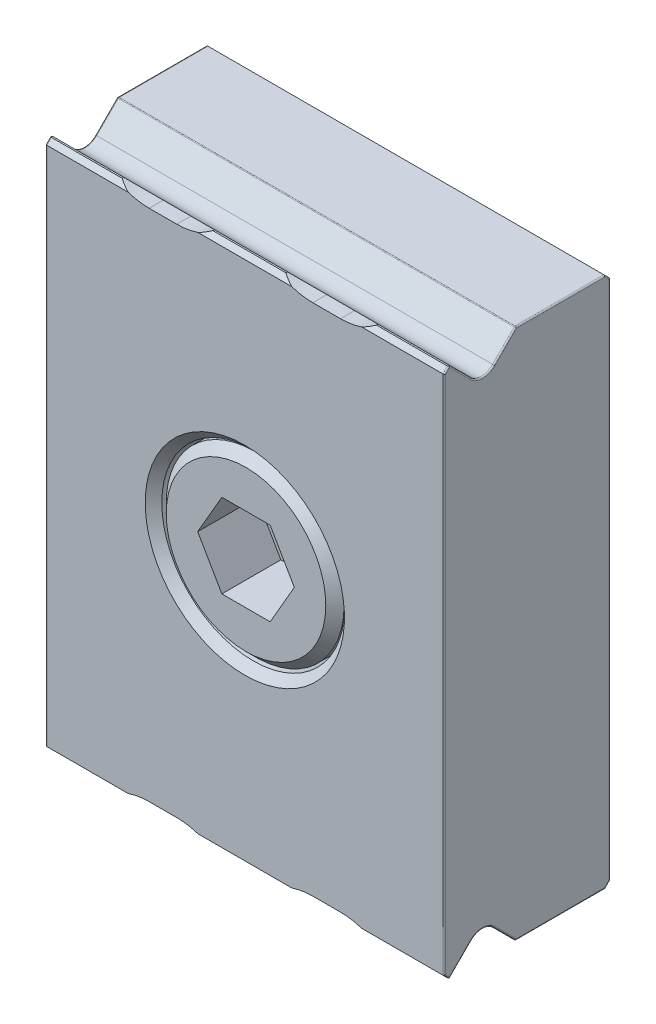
ISO-10303-21;
HEADER;
FILE_DESCRIPTION(('STEP AP214'),'2;1');
FILE_NAME('part.step','',(''),(''),'','','');
FILE_SCHEMA(('AUTOMOTIVE_DESIGN { 1 0 10303 214 1 1 1 1 }'));
ENDSEC;
DATA;
#1=APPLICATION_CONTEXT('core data for automotive mechanical design processes');
#2=APPLICATION_PROTOCOL_DEFINITION('international standard','automotive_design',2000,#1);
#3=PRODUCT_CONTEXT('',#1,'mechanical');
#4=PRODUCT('Part','Part','',(#3));
#5=PRODUCT_RELATED_PRODUCT_CATEGORY('part','',(#4));
#6=PRODUCT_DEFINITION_FORMATION('','',#4);
#7=PRODUCT_DEFINITION_CONTEXT('part definition',#1,'design');
#8=PRODUCT_DEFINITION('design','',#6,#7);
#9=PRODUCT_DEFINITION_SHAPE('','',#8);
#10=(LENGTH_UNIT() NAMED_UNIT(*) SI_UNIT(.MILLI.,.METRE.));
#11=(NAMED_UNIT(*) PLANE_ANGLE_UNIT() SI_UNIT($,.RADIAN.));
#12=(NAMED_UNIT(*) SI_UNIT($,.STERADIAN.) SOLID_ANGLE_UNIT());
#13=UNCERTAINTY_MEASURE_WITH_UNIT(LENGTH_MEASURE(1.E-05),#10,'distance_accuracy_value','');
#14=(GEOMETRIC_REPRESENTATION_CONTEXT(3) GLOBAL_UNCERTAINTY_ASSIGNED_CONTEXT((#13)) GLOBAL_UNIT_ASSIGNED_CONTEXT((#10,
#11,#12)) REPRESENTATION_CONTEXT('',''));
#15=CARTESIAN_POINT('',(0.,0.,0.));
#16=DIRECTION('',(0.,0.,1.));
#17=DIRECTION('',(1.,0.,0.));
#18=AXIS2_PLACEMENT_3D('',#15,#16,#17);
#19=CARTESIAN_POINT('',(-9.525,12.6619,7.18819999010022));
#20=DIRECTION('',(0.,-1.,0.));
#21=DIRECTION('',(1.,0.,0.));
#22=AXIS2_PLACEMENT_3D('',#19,#20,#21);
#23=PLANE('',#22);
#24=DIRECTION('',(1.,0.,0.));
#25=VECTOR('',#24,1.);
#26=CARTESIAN_POINT('',(-9.525,12.6619,7.65809999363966));
#27=LINE('',#26,#25);
#28=CARTESIAN_POINT('',(-1.74492719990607,12.6619,7.65809999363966));
#29=VERTEX_POINT('',#28);
#30=CARTESIAN_POINT('',(1.74492719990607,12.6619,7.65809999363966));
#31=VERTEX_POINT('',#30);
#32=EDGE_CURVE('E1141',#29,#31,#27,.T.);
#33=ORIENTED_EDGE('',*,*,#32,.F.);
#34=DIRECTION('',(0.,0.,-1.));
#35=VECTOR('',#34,1.);
#36=CARTESIAN_POINT('',(-1.74492719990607,12.6619,7.95019999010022));
#37=LINE('',#36,#35);
#38=CARTESIAN_POINT('',(-1.74492719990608,12.6619,7.73429999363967));
#39=VERTEX_POINT('',#38);
#40=EDGE_CURVE('E1103',#29,#39,#37,.F.);
#41=ORIENTED_EDGE('',*,*,#40,.T.);
#42=DIRECTION('',(1.,0.,0.));
#43=VECTOR('',#42,1.);
#44=CARTESIAN_POINT('',(9.525,12.6619,7.73429999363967));
#45=LINE('',#44,#43);
#46=CARTESIAN_POINT('',(1.74492719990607,12.6619,7.73429999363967));
#47=VERTEX_POINT('',#46);
#48=EDGE_CURVE('E581',#39,#47,#45,.T.);
#49=ORIENTED_EDGE('',*,*,#48,.T.);
#50=DIRECTION('',(0.,0.,1.));
#51=VECTOR('',#50,1.);
#52=CARTESIAN_POINT('',(1.74492719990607,12.6619,7.18819999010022));
#53=LINE('',#52,#51);
#54=EDGE_CURVE('E1139',#31,#47,#53,.T.);
#55=ORIENTED_EDGE('',*,*,#54,.F.);
#56=EDGE_LOOP('',(#33,#41,#49,#55));
#57=FACE_BOUND('',#56,.T.);
#58=ADVANCED_FACE('F14',(#57),#23,.F.);
#59=CARTESIAN_POINT('',(-9.525,-12.6619,7.18819999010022));
#60=DIRECTION('',(0.,1.,0.));
#61=DIRECTION('',(-1.,0.,0.));
#62=AXIS2_PLACEMENT_3D('',#59,#60,#61);
#63=PLANE('',#62);
#64=DIRECTION('',(1.,0.,0.));
#65=VECTOR('',#64,1.);
#66=CARTESIAN_POINT('',(9.525,-12.6619,7.65809999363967));
#67=LINE('',#66,#65);
#68=CARTESIAN_POINT('',(-1.74492719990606,-12.6619,7.65809999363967));
#69=VERTEX_POINT('',#68);
#70=CARTESIAN_POINT('',(1.74492719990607,-12.6619,7.65809999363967));
#71=VERTEX_POINT('',#70);
#72=EDGE_CURVE('E1133',#69,#71,#67,.T.);
#73=ORIENTED_EDGE('',*,*,#72,.T.);
#74=DIRECTION('',(0.,0.,-1.));
#75=VECTOR('',#74,1.);
#76=CARTESIAN_POINT('',(1.74492719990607,-12.6619,7.95019999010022));
#77=LINE('',#76,#75);
#78=CARTESIAN_POINT('',(1.74492719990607,-12.6619,7.73429999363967));
#79=VERTEX_POINT('',#78);
#80=EDGE_CURVE('E611',#71,#79,#77,.F.);
#81=ORIENTED_EDGE('',*,*,#80,.T.);
#82=DIRECTION('',(1.,0.,0.));
#83=VECTOR('',#82,1.);
#84=CARTESIAN_POINT('',(9.525,-12.6619,7.73429999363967));
#85=LINE('',#84,#83);
#86=CARTESIAN_POINT('',(-1.74492719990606,-12.6619,7.73429999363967));
#87=VERTEX_POINT('',#86);
#88=EDGE_CURVE('E607',#79,#87,#85,.F.);
#89=ORIENTED_EDGE('',*,*,#88,.T.);
#90=DIRECTION('',(0.,0.,1.));
#91=VECTOR('',#90,1.);
#92=CARTESIAN_POINT('',(-1.74492719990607,-12.6619,7.18819999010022));
#93=LINE('',#92,#91);
#94=EDGE_CURVE('E459',#69,#87,#93,.T.);
#95=ORIENTED_EDGE('',*,*,#94,.F.);
#96=EDGE_LOOP('',(#73,#81,#89,#95));
#97=FACE_BOUND('',#96,.T.);
#98=ADVANCED_FACE('F768',(#97),#63,.F.);
#99=CARTESIAN_POINT('',(4.57200010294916,-15.4568538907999,7.95019999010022));
#100=DIRECTION('',(0.,0.,-1.));
#101=DIRECTION('',(0.,1.,0.));
#102=AXIS2_PLACEMENT_3D('',#99,#100,#101);
#103=CYLINDRICAL_SURFACE('',#102,3.175);
#104=CARTESIAN_POINT('',(4.57200010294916,-15.4568538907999,7.95019999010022));
#105=DIRECTION('',(0.,0.,-1.));
#106=DIRECTION('',(0.,1.,0.));
#107=AXIS2_PLACEMENT_3D('',#104,#105,#106);
#108=CIRCLE('',#107,3.175);
#109=CARTESIAN_POINT('',(5.57966268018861,-12.4460000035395,7.95019999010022));
#110=VERTEX_POINT('',#109);
#111=CARTESIAN_POINT('',(4.57200010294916,-12.2818538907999,7.95019999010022));
#112=VERTEX_POINT('',#111);
#113=EDGE_CURVE('E563',#110,#112,#108,.F.);
#114=ORIENTED_EDGE('',*,*,#113,.T.);
#115=DIRECTION('',(0.,0.,1.));
#116=VECTOR('',#115,1.);
#117=CARTESIAN_POINT('',(4.57200010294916,-12.2818538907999,7.95019999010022));
#118=LINE('',#117,#116);
#119=CARTESIAN_POINT('',(4.57200010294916,-12.2818538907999,7.27805388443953));
#120=VERTEX_POINT('',#119);
#121=EDGE_CURVE('E1125',#120,#112,#118,.T.);
#122=ORIENTED_EDGE('',*,*,#121,.F.);
#123=CARTESIAN_POINT('',(4.57200010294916,-15.4568538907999,10.4530538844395));
#124=DIRECTION('',(0.,0.707106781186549,0.707106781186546));
#125=DIRECTION('',(0.,0.707106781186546,-0.707106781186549));
#126=AXIS2_PLACEMENT_3D('',#123,#124,#125);
#127=ELLIPSE('',#126,4.49012806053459,3.175);
#128=CARTESIAN_POINT('',(6.07827290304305,-12.6619,7.65809999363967));
#129=VERTEX_POINT('',#128);
#130=EDGE_CURVE('E616',#129,#120,#127,.T.);
#131=ORIENTED_EDGE('',*,*,#130,.F.);
#132=DIRECTION('',(0.,0.,-1.));
#133=VECTOR('',#132,1.);
#134=CARTESIAN_POINT('',(6.07827290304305,-12.6619,7.95019999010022));
#135=LINE('',#134,#133);
#136=CARTESIAN_POINT('',(6.07827290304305,-12.6619,7.73429999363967));
#137=VERTEX_POINT('',#136);
#138=EDGE_CURVE('E618',#137,#129,#135,.T.);
#139=ORIENTED_EDGE('',*,*,#138,.F.);
#140=CARTESIAN_POINT('',(4.57200010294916,-15.4568538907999,4.93934610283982));
#141=DIRECTION('',(0.,0.707106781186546,-0.70710678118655));
#142=DIRECTION('',(0.,-0.70710678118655,-0.707106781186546));
#143=AXIS2_PLACEMENT_3D('',#140,#141,#142);
#144=ELLIPSE('',#143,4.49012806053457,3.175);
#145=EDGE_CURVE('E567',#137,#110,#144,.F.);
#146=ORIENTED_EDGE('',*,*,#145,.T.);
#147=EDGE_LOOP('',(#114,#122,#131,#139,#146));
#148=FACE_BOUND('',#147,.T.);
#149=ADVANCED_FACE('F775',(#148),#103,.F.);
#150=CARTESIAN_POINT('',(4.57200010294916,-12.2818538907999,7.95019999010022));
#151=DIRECTION('',(0.,-1.,0.));
#152=DIRECTION('',(1.,0.,0.));
#153=AXIS2_PLACEMENT_3D('',#150,#151,#152);
#154=PLANE('',#153);
#155=DIRECTION('',(1.,0.,0.));
#156=VECTOR('',#155,1.);
#157=CARTESIAN_POINT('',(9.525,-12.2818538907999,7.95019999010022));
#158=LINE('',#157,#156);
#159=CARTESIAN_POINT('',(3.2512,-12.2818538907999,7.95019999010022));
#160=VERTEX_POINT('',#159);
#161=EDGE_CURVE('E562',#112,#160,#158,.F.);
#162=ORIENTED_EDGE('',*,*,#161,.T.);
#163=DIRECTION('',(0.,0.,-1.));
#164=VECTOR('',#163,1.);
#165=CARTESIAN_POINT('',(3.2512,-12.2818538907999,7.95019999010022));
#166=LINE('',#165,#164);
#167=CARTESIAN_POINT('',(3.2512,-12.2818538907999,7.27805388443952));
#168=VERTEX_POINT('',#167);
#169=EDGE_CURVE('E615',#160,#168,#166,.T.);
#170=ORIENTED_EDGE('',*,*,#169,.T.);
#171=DIRECTION('',(1.,0.,0.));
#172=VECTOR('',#171,1.);
#173=CARTESIAN_POINT('',(4.57200010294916,-12.2818538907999,7.27805388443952));
#174=LINE('',#173,#172);
#175=EDGE_CURVE('E450',#168,#120,#174,.T.);
#176=ORIENTED_EDGE('',*,*,#175,.T.);
#177=ORIENTED_EDGE('',*,*,#121,.T.);
#178=EDGE_LOOP('',(#162,#170,#176,#177));
#179=FACE_BOUND('',#178,.T.);
#180=ADVANCED_FACE('F1331',(#179),#154,.T.);
#181=CARTESIAN_POINT('',(3.2512,-15.4568538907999,7.95019999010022));
#182=DIRECTION('',(0.,0.,-1.));
#183=DIRECTION('',(0.,1.,0.));
#184=AXIS2_PLACEMENT_3D('',#181,#182,#183);
#185=CYLINDRICAL_SURFACE('',#184,3.175);
#186=ORIENTED_EDGE('',*,*,#80,.F.);
#187=CARTESIAN_POINT('',(3.2512,-15.4568538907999,10.4530538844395));
#188=DIRECTION('',(0.,0.707106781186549,0.707106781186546));
#189=DIRECTION('',(0.,0.707106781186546,-0.707106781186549));
#190=AXIS2_PLACEMENT_3D('',#187,#188,#189);
#191=ELLIPSE('',#190,4.49012806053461,3.175);
#192=EDGE_CURVE('E612',#168,#71,#191,.T.);
#193=ORIENTED_EDGE('',*,*,#192,.F.);
#194=ORIENTED_EDGE('',*,*,#169,.F.);
#195=CARTESIAN_POINT('',(3.2512,-15.4568538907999,7.95019999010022));
#196=DIRECTION('',(0.,0.,-1.));
#197=DIRECTION('',(0.,1.,0.));
#198=AXIS2_PLACEMENT_3D('',#195,#196,#197);
#199=CIRCLE('',#198,3.175);
#200=CARTESIAN_POINT('',(2.24353742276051,-12.4460000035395,7.95019999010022));
#201=VERTEX_POINT('',#200);
#202=EDGE_CURVE('E559',#160,#201,#199,.F.);
#203=ORIENTED_EDGE('',*,*,#202,.T.);
#204=CARTESIAN_POINT('',(3.2512,-15.4568538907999,4.93934610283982));
#205=DIRECTION('',(0.,0.707106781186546,-0.70710678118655));
#206=DIRECTION('',(0.,-0.70710678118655,-0.707106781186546));
#207=AXIS2_PLACEMENT_3D('',#204,#205,#206);
#208=ELLIPSE('',#207,4.49012806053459,3.175);
#209=EDGE_CURVE('E608',#201,#79,#208,.F.);
#210=ORIENTED_EDGE('',*,*,#209,.T.);
#211=EDGE_LOOP('',(#186,#193,#194,#203,#210));
#212=FACE_BOUND('',#211,.T.);
#213=ADVANCED_FACE('F1333',(#212),#185,.F.);
#214=CARTESIAN_POINT('',(9.525,-12.7,7.69619999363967));
#215=DIRECTION('',(0.,0.707106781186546,-0.70710678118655));
#216=DIRECTION('',(0.,0.70710678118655,0.707106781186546));
#217=AXIS2_PLACEMENT_3D('',#214,#215,#216);
#218=PLANE('',#217);
#219=ORIENTED_EDGE('',*,*,#88,.F.);
#220=ORIENTED_EDGE('',*,*,#209,.F.);
#221=DIRECTION('',(1.,0.,0.));
#222=VECTOR('',#221,1.);
#223=CARTESIAN_POINT('',(9.525,-12.4460000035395,7.95019999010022));
#224=LINE('',#223,#222);
#225=CARTESIAN_POINT('',(-2.24353742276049,-12.4460000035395,7.95019999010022));
#226=VERTEX_POINT('',#225);
#227=EDGE_CURVE('E558',#201,#226,#224,.F.);
#228=ORIENTED_EDGE('',*,*,#227,.T.);
#229=CARTESIAN_POINT('',(-3.2512,-15.4568538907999,4.93934610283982));
#230=DIRECTION('',(0.,0.707106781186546,-0.70710678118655));
#231=DIRECTION('',(0.,-0.70710678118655,-0.707106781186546));
#232=AXIS2_PLACEMENT_3D('',#229,#230,#231);
#233=ELLIPSE('',#232,4.49012806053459,3.175);
#234=EDGE_CURVE('E600',#226,#87,#233,.T.);
#235=ORIENTED_EDGE('',*,*,#234,.T.);
#236=EDGE_LOOP('',(#219,#220,#228,#235));
#237=FACE_BOUND('',#236,.T.);
#238=ADVANCED_FACE('F1156',(#237),#218,.F.);
#239=CARTESIAN_POINT('',(-3.2512,-15.4568538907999,7.95019999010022));
#240=DIRECTION('',(0.,0.,-1.));
#241=DIRECTION('',(0.,1.,0.));
#242=AXIS2_PLACEMENT_3D('',#239,#240,#241);
#243=CYLINDRICAL_SURFACE('',#242,3.175);
#244=CARTESIAN_POINT('',(-3.2512,-15.4568538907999,7.95019999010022));
#245=DIRECTION('',(0.,0.,-1.));
#246=DIRECTION('',(0.,1.,0.));
#247=AXIS2_PLACEMENT_3D('',#244,#245,#246);
#248=CIRCLE('',#247,3.175);
#249=CARTESIAN_POINT('',(-3.2512,-12.2818538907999,7.95019999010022));
#250=VERTEX_POINT('',#249);
#251=EDGE_CURVE('E555',#226,#250,#248,.F.);
#252=ORIENTED_EDGE('',*,*,#251,.T.);
#253=DIRECTION('',(0.,0.,1.));
#254=VECTOR('',#253,1.);
#255=CARTESIAN_POINT('',(-3.2512,-12.2818538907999,7.95019999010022));
#256=LINE('',#255,#254);
#257=CARTESIAN_POINT('',(-3.2512,-12.2818538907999,7.27805388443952));
#258=VERTEX_POINT('',#257);
#259=EDGE_CURVE('E1118',#258,#250,#256,.T.);
#260=ORIENTED_EDGE('',*,*,#259,.F.);
#261=CARTESIAN_POINT('',(-3.2512,-15.4568538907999,10.4530538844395));
#262=DIRECTION('',(0.,0.707106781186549,0.707106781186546));
#263=DIRECTION('',(0.,0.707106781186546,-0.707106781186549));
#264=AXIS2_PLACEMENT_3D('',#261,#262,#263);
#265=ELLIPSE('',#264,4.49012806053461,3.175);
#266=EDGE_CURVE('E604',#69,#258,#265,.T.);
#267=ORIENTED_EDGE('',*,*,#266,.F.);
#268=ORIENTED_EDGE('',*,*,#94,.T.);
#269=ORIENTED_EDGE('',*,*,#234,.F.);
#270=EDGE_LOOP('',(#252,#260,#267,#268,#269));
#271=FACE_BOUND('',#270,.T.);
#272=ADVANCED_FACE('F1148',(#271),#243,.F.);
#273=CARTESIAN_POINT('',(-4.57200010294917,-12.2818538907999,7.95019999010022));
#274=DIRECTION('',(0.,-1.,0.));
#275=DIRECTION('',(1.,0.,0.));
#276=AXIS2_PLACEMENT_3D('',#273,#274,#275);
#277=PLANE('',#276);
#278=DIRECTION('',(1.,0.,0.));
#279=VECTOR('',#278,1.);
#280=CARTESIAN_POINT('',(9.525,-12.2818538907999,7.95019999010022));
#281=LINE('',#280,#279);
#282=CARTESIAN_POINT('',(-4.57200010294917,-12.2818538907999,7.95019999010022));
#283=VERTEX_POINT('',#282);
#284=EDGE_CURVE('E554',#250,#283,#281,.F.);
#285=ORIENTED_EDGE('',*,*,#284,.T.);
#286=DIRECTION('',(0.,0.,-1.));
#287=VECTOR('',#286,1.);
#288=CARTESIAN_POINT('',(-4.57200010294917,-12.2818538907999,7.95019999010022));
#289=LINE('',#288,#287);
#290=CARTESIAN_POINT('',(-4.57200010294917,-12.2818538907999,7.27805388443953));
#291=VERTEX_POINT('',#290);
#292=EDGE_CURVE('E599',#283,#291,#289,.T.);
#293=ORIENTED_EDGE('',*,*,#292,.T.);
#294=DIRECTION('',(1.,0.,0.));
#295=VECTOR('',#294,1.);
#296=CARTESIAN_POINT('',(-4.57200010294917,-12.2818538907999,7.27805388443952));
#297=LINE('',#296,#295);
#298=EDGE_CURVE('E603',#291,#258,#297,.T.);
#299=ORIENTED_EDGE('',*,*,#298,.T.);
#300=ORIENTED_EDGE('',*,*,#259,.T.);
#301=EDGE_LOOP('',(#285,#293,#299,#300));
#302=FACE_BOUND('',#301,.T.);
#303=ADVANCED_FACE('F1339',(#302),#277,.T.);
#304=CARTESIAN_POINT('',(-4.57200010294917,-15.4568538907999,7.95019999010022));
#305=DIRECTION('',(0.,0.,-1.));
#306=DIRECTION('',(0.,1.,0.));
#307=AXIS2_PLACEMENT_3D('',#304,#305,#306);
#308=CYLINDRICAL_SURFACE('',#307,3.175);
#309=DIRECTION('',(0.,0.,-1.));
#310=VECTOR('',#309,1.);
#311=CARTESIAN_POINT('',(-6.07827290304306,-12.6619,7.95019999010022));
#312=LINE('',#311,#310);
#313=CARTESIAN_POINT('',(-6.07827290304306,-12.6619,7.65809999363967));
#314=VERTEX_POINT('',#313);
#315=CARTESIAN_POINT('',(-6.07827290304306,-12.6619,7.73429999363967));
#316=VERTEX_POINT('',#315);
#317=EDGE_CURVE('E595',#314,#316,#312,.F.);
#318=ORIENTED_EDGE('',*,*,#317,.F.);
#319=CARTESIAN_POINT('',(-4.57200010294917,-15.4568538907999,10.4530538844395));
#320=DIRECTION('',(0.,0.707106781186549,0.707106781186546));
#321=DIRECTION('',(0.,0.707106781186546,-0.707106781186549));
#322=AXIS2_PLACEMENT_3D('',#319,#320,#321);
#323=ELLIPSE('',#322,4.49012806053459,3.175);
#324=EDGE_CURVE('E596',#291,#314,#323,.T.);
#325=ORIENTED_EDGE('',*,*,#324,.F.);
#326=ORIENTED_EDGE('',*,*,#292,.F.);
#327=CARTESIAN_POINT('',(-4.57200010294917,-15.4568538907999,7.95019999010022));
#328=DIRECTION('',(0.,0.,-1.));
#329=DIRECTION('',(0.,1.,0.));
#330=AXIS2_PLACEMENT_3D('',#327,#328,#329);
#331=CIRCLE('',#330,3.175);
#332=CARTESIAN_POINT('',(-5.57966268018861,-12.4460000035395,7.95019999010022));
#333=VERTEX_POINT('',#332);
#334=EDGE_CURVE('E550',#283,#333,#331,.F.);
#335=ORIENTED_EDGE('',*,*,#334,.T.);
#336=CARTESIAN_POINT('',(-4.57200010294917,-15.4568538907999,4.93934610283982));
#337=DIRECTION('',(0.,0.707106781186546,-0.70710678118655));
#338=DIRECTION('',(0.,-0.70710678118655,-0.707106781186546));
#339=AXIS2_PLACEMENT_3D('',#336,#337,#338);
#340=ELLIPSE('',#339,4.49012806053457,3.175);
#341=EDGE_CURVE('E591',#333,#316,#340,.F.);
#342=ORIENTED_EDGE('',*,*,#341,.T.);
#343=EDGE_LOOP('',(#318,#325,#326,#335,#342));
#344=FACE_BOUND('',#343,.T.);
#345=ADVANCED_FACE('F1342',(#344),#308,.F.);
#346=CARTESIAN_POINT('',(-4.57200010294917,15.4568538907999,7.95019999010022));
#347=DIRECTION('',(0.,0.,-1.));
#348=DIRECTION('',(0.,1.,0.));
#349=AXIS2_PLACEMENT_3D('',#346,#347,#348);
#350=CYLINDRICAL_SURFACE('',#349,3.175);
#351=DIRECTION('',(0.,0.,1.));
#352=VECTOR('',#351,1.);
#353=CARTESIAN_POINT('',(-6.07827290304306,12.6619,7.18819999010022));
#354=LINE('',#353,#352);
#355=CARTESIAN_POINT('',(-6.07827290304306,12.6619,7.65809999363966));
#356=VERTEX_POINT('',#355);
#357=CARTESIAN_POINT('',(-6.07827290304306,12.6619,7.73429999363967));
#358=VERTEX_POINT('',#357);
#359=EDGE_CURVE('E633',#356,#358,#354,.T.);
#360=ORIENTED_EDGE('',*,*,#359,.T.);
#361=CARTESIAN_POINT('',(-4.57200010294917,15.4568538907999,4.93934610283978));
#362=DIRECTION('',(0.,-0.70710678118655,-0.707106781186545));
#363=DIRECTION('',(0.,0.707106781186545,-0.70710678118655));
#364=AXIS2_PLACEMENT_3D('',#361,#362,#363);
#365=ELLIPSE('',#364,4.4901280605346,3.175);
#366=CARTESIAN_POINT('',(-5.57966268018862,12.4460000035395,7.95019999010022));
#367=VERTEX_POINT('',#366);
#368=EDGE_CURVE('E586',#367,#358,#365,.T.);
#369=ORIENTED_EDGE('',*,*,#368,.F.);
#370=CARTESIAN_POINT('',(-4.57200010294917,15.4568538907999,7.95019999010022));
#371=DIRECTION('',(0.,0.,-1.));
#372=DIRECTION('',(0.,1.,0.));
#373=AXIS2_PLACEMENT_3D('',#370,#371,#372);
#374=CIRCLE('',#373,3.175);
#375=CARTESIAN_POINT('',(-4.57200010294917,12.2818538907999,7.95019999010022));
#376=VERTEX_POINT('',#375);
#377=EDGE_CURVE('E546',#367,#376,#374,.F.);
#378=ORIENTED_EDGE('',*,*,#377,.T.);
#379=DIRECTION('',(0.,0.,1.));
#380=VECTOR('',#379,1.);
#381=CARTESIAN_POINT('',(-4.57200010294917,12.2818538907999,7.95019999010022));
#382=LINE('',#381,#380);
#383=CARTESIAN_POINT('',(-4.57200010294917,12.2818538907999,7.27805388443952));
#384=VERTEX_POINT('',#383);
#385=EDGE_CURVE('E589',#384,#376,#382,.T.);
#386=ORIENTED_EDGE('',*,*,#385,.F.);
#387=CARTESIAN_POINT('',(-4.57200010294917,15.4568538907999,10.4530538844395));
#388=DIRECTION('',(0.,-0.707106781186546,0.70710678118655));
#389=DIRECTION('',(0.,-0.70710678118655,-0.707106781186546));
#390=AXIS2_PLACEMENT_3D('',#387,#388,#389);
#391=ELLIPSE('',#390,4.49012806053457,3.175);
#392=EDGE_CURVE('E428',#384,#356,#391,.F.);
#393=ORIENTED_EDGE('',*,*,#392,.T.);
#394=EDGE_LOOP('',(#360,#369,#378,#386,#393));
#395=FACE_BOUND('',#394,.T.);
#396=ADVANCED_FACE('F1289',(#395),#350,.F.);
#397=CARTESIAN_POINT('',(-4.57200010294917,12.2818538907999,7.95019999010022));
#398=DIRECTION('',(0.,1.,0.));
#399=DIRECTION('',(-1.,0.,0.));
#400=AXIS2_PLACEMENT_3D('',#397,#398,#399);
#401=PLANE('',#400);
#402=DIRECTION('',(1.,0.,0.));
#403=VECTOR('',#402,1.);
#404=CARTESIAN_POINT('',(9.525,12.2818538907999,7.95019999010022));
#405=LINE('',#404,#403);
#406=CARTESIAN_POINT('',(-3.2512,12.2818538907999,7.95019999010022));
#407=VERTEX_POINT('',#406);
#408=EDGE_CURVE('E545',#376,#407,#405,.T.);
#409=ORIENTED_EDGE('',*,*,#408,.T.);
#410=DIRECTION('',(0.,0.,-1.));
#411=VECTOR('',#410,1.);
#412=CARTESIAN_POINT('',(-3.2512,12.2818538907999,7.95019999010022));
#413=LINE('',#412,#411);
#414=CARTESIAN_POINT('',(-3.2512,12.2818538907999,7.27805388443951));
#415=VERTEX_POINT('',#414);
#416=EDGE_CURVE('E585',#407,#415,#413,.T.);
#417=ORIENTED_EDGE('',*,*,#416,.T.);
#418=DIRECTION('',(1.,0.,0.));
#419=VECTOR('',#418,1.);
#420=CARTESIAN_POINT('',(9.525,12.2818538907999,7.27805388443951));
#421=LINE('',#420,#419);
#422=EDGE_CURVE('E452',#415,#384,#421,.F.);
#423=ORIENTED_EDGE('',*,*,#422,.T.);
#424=ORIENTED_EDGE('',*,*,#385,.T.);
#425=EDGE_LOOP('',(#409,#417,#423,#424));
#426=FACE_BOUND('',#425,.T.);
#427=ADVANCED_FACE('F1295',(#426),#401,.T.);
#428=CARTESIAN_POINT('',(-3.2512,15.4568538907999,7.95019999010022));
#429=DIRECTION('',(0.,0.,-1.));
#430=DIRECTION('',(0.,1.,0.));
#431=AXIS2_PLACEMENT_3D('',#428,#429,#430);
#432=CYLINDRICAL_SURFACE('',#431,3.175);
#433=ORIENTED_EDGE('',*,*,#416,.F.);
#434=CARTESIAN_POINT('',(-3.2512,15.4568538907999,7.95019999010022));
#435=DIRECTION('',(0.,0.,-1.));
#436=DIRECTION('',(0.,1.,0.));
#437=AXIS2_PLACEMENT_3D('',#434,#435,#436);
#438=CIRCLE('',#437,3.175);
#439=CARTESIAN_POINT('',(-2.24353742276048,12.4460000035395,7.95019999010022));
#440=VERTEX_POINT('',#439);
#441=EDGE_CURVE('E542',#407,#440,#438,.F.);
#442=ORIENTED_EDGE('',*,*,#441,.T.);
#443=CARTESIAN_POINT('',(-3.2512,15.4568538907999,4.93934610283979));
#444=DIRECTION('',(0.,-0.70710678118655,-0.707106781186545));
#445=DIRECTION('',(0.,0.707106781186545,-0.70710678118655));
#446=AXIS2_PLACEMENT_3D('',#443,#444,#445);
#447=ELLIPSE('',#446,4.49012806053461,3.175);
#448=EDGE_CURVE('E582',#440,#39,#447,.F.);
#449=ORIENTED_EDGE('',*,*,#448,.T.);
#450=ORIENTED_EDGE('',*,*,#40,.F.);
#451=CARTESIAN_POINT('',(-3.2512,15.4568538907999,10.4530538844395));
#452=DIRECTION('',(0.,-0.707106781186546,0.70710678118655));
#453=DIRECTION('',(0.,-0.70710678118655,-0.707106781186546));
#454=AXIS2_PLACEMENT_3D('',#451,#452,#453);
#455=ELLIPSE('',#454,4.49012806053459,3.175);
#456=EDGE_CURVE('E455',#29,#415,#455,.F.);
#457=ORIENTED_EDGE('',*,*,#456,.T.);
#458=EDGE_LOOP('',(#433,#442,#449,#450,#457));
#459=FACE_BOUND('',#458,.T.);
#460=ADVANCED_FACE('F1300',(#459),#432,.F.);
#461=CARTESIAN_POINT('',(9.525,12.7,7.69619999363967));
#462=DIRECTION('',(0.,-0.70710678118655,-0.707106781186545));
#463=DIRECTION('',(0.,0.707106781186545,-0.70710678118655));
#464=AXIS2_PLACEMENT_3D('',#461,#462,#463);
#465=PLANE('',#464);
#466=ORIENTED_EDGE('',*,*,#48,.F.);
#467=ORIENTED_EDGE('',*,*,#448,.F.);
#468=DIRECTION('',(1.,0.,0.));
#469=VECTOR('',#468,1.);
#470=CARTESIAN_POINT('',(9.525,12.4460000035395,7.95019999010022));
#471=LINE('',#470,#469);
#472=CARTESIAN_POINT('',(2.24353742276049,12.4460000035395,7.95019999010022));
#473=VERTEX_POINT('',#472);
#474=EDGE_CURVE('E541',#440,#473,#471,.T.);
#475=ORIENTED_EDGE('',*,*,#474,.T.);
#476=CARTESIAN_POINT('',(3.2512,15.4568538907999,4.93934610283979));
#477=DIRECTION('',(0.,-0.70710678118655,-0.707106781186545));
#478=DIRECTION('',(0.,0.707106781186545,-0.70710678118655));
#479=AXIS2_PLACEMENT_3D('',#476,#477,#478);
#480=ELLIPSE('',#479,4.49012806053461,3.175);
#481=EDGE_CURVE('E577',#473,#47,#480,.T.);
#482=ORIENTED_EDGE('',*,*,#481,.T.);
#483=EDGE_LOOP('',(#466,#467,#475,#482));
#484=FACE_BOUND('',#483,.T.);
#485=ADVANCED_FACE('F1302',(#484),#465,.F.);
#486=CARTESIAN_POINT('',(3.2512,15.4568538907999,7.95019999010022));
#487=DIRECTION('',(0.,0.,-1.));
#488=DIRECTION('',(0.,1.,0.));
#489=AXIS2_PLACEMENT_3D('',#486,#487,#488);
#490=CYLINDRICAL_SURFACE('',#489,3.175);
#491=CARTESIAN_POINT('',(3.2512,15.4568538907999,7.95019999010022));
#492=DIRECTION('',(0.,0.,-1.));
#493=DIRECTION('',(0.,1.,0.));
#494=AXIS2_PLACEMENT_3D('',#491,#492,#493);
#495=CIRCLE('',#494,3.175);
#496=CARTESIAN_POINT('',(3.2512,12.2818538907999,7.95019999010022));
#497=VERTEX_POINT('',#496);
#498=EDGE_CURVE('E538',#473,#497,#495,.F.);
#499=ORIENTED_EDGE('',*,*,#498,.T.);
#500=DIRECTION('',(0.,0.,1.));
#501=VECTOR('',#500,1.);
#502=CARTESIAN_POINT('',(3.2512,12.2818538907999,7.95019999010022));
#503=LINE('',#502,#501);
#504=CARTESIAN_POINT('',(3.2512,12.2818538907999,7.27805388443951));
#505=VERTEX_POINT('',#504);
#506=EDGE_CURVE('E580',#505,#497,#503,.T.);
#507=ORIENTED_EDGE('',*,*,#506,.F.);
#508=CARTESIAN_POINT('',(3.2512,15.4568538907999,10.4530538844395));
#509=DIRECTION('',(0.,-0.707106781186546,0.70710678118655));
#510=DIRECTION('',(0.,-0.70710678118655,-0.707106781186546));
#511=AXIS2_PLACEMENT_3D('',#508,#509,#510);
#512=ELLIPSE('',#511,4.49012806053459,3.175);
#513=EDGE_CURVE('E457',#505,#31,#512,.F.);
#514=ORIENTED_EDGE('',*,*,#513,.T.);
#515=ORIENTED_EDGE('',*,*,#54,.T.);
#516=ORIENTED_EDGE('',*,*,#481,.F.);
#517=EDGE_LOOP('',(#499,#507,#514,#515,#516));
#518=FACE_BOUND('',#517,.T.);
#519=ADVANCED_FACE('F1308',(#518),#490,.F.);
#520=CARTESIAN_POINT('',(4.57200010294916,12.2818538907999,7.95019999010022));
#521=DIRECTION('',(0.,1.,0.));
#522=DIRECTION('',(-1.,0.,0.));
#523=AXIS2_PLACEMENT_3D('',#520,#521,#522);
#524=PLANE('',#523);
#525=DIRECTION('',(1.,0.,0.));
#526=VECTOR('',#525,1.);
#527=CARTESIAN_POINT('',(9.525,12.2818538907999,7.95019999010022));
#528=LINE('',#527,#526);
#529=CARTESIAN_POINT('',(4.57200010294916,12.2818538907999,7.95019999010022));
#530=VERTEX_POINT('',#529);
#531=EDGE_CURVE('E537',#497,#530,#528,.T.);
#532=ORIENTED_EDGE('',*,*,#531,.T.);
#533=DIRECTION('',(0.,0.,-1.));
#534=VECTOR('',#533,1.);
#535=CARTESIAN_POINT('',(4.57200010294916,12.2818538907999,7.95019999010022));
#536=LINE('',#535,#534);
#537=CARTESIAN_POINT('',(4.57200010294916,12.2818538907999,7.27805388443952));
#538=VERTEX_POINT('',#537);
#539=EDGE_CURVE('E1096',#530,#538,#536,.T.);
#540=ORIENTED_EDGE('',*,*,#539,.T.);
#541=DIRECTION('',(1.,0.,0.));
#542=VECTOR('',#541,1.);
#543=CARTESIAN_POINT('',(9.525,12.2818538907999,7.27805388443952));
#544=LINE('',#543,#542);
#545=EDGE_CURVE('E311',#538,#505,#544,.F.);
#546=ORIENTED_EDGE('',*,*,#545,.T.);
#547=ORIENTED_EDGE('',*,*,#506,.T.);
#548=EDGE_LOOP('',(#532,#540,#546,#547));
#549=FACE_BOUND('',#548,.T.);
#550=ADVANCED_FACE('F1310',(#549),#524,.T.);
#551=CARTESIAN_POINT('',(4.57200010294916,15.4568538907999,7.95019999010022));
#552=DIRECTION('',(0.,0.,-1.));
#553=DIRECTION('',(0.,1.,0.));
#554=AXIS2_PLACEMENT_3D('',#551,#552,#553);
#555=CYLINDRICAL_SURFACE('',#554,3.175);
#556=DIRECTION('',(0.,0.,-1.));
#557=VECTOR('',#556,1.);
#558=CARTESIAN_POINT('',(6.07827290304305,12.6619,7.95019999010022));
#559=LINE('',#558,#557);
#560=CARTESIAN_POINT('',(6.07827290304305,12.6619,7.65809999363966));
#561=VERTEX_POINT('',#560);
#562=CARTESIAN_POINT('',(6.07827290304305,12.6619,7.73429999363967));
#563=VERTEX_POINT('',#562);
#564=EDGE_CURVE('E576',#561,#563,#559,.F.);
#565=ORIENTED_EDGE('',*,*,#564,.F.);
#566=CARTESIAN_POINT('',(4.57200010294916,15.4568538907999,10.4530538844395));
#567=DIRECTION('',(0.,-0.707106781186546,0.70710678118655));
#568=DIRECTION('',(0.,-0.70710678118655,-0.707106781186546));
#569=AXIS2_PLACEMENT_3D('',#566,#567,#568);
#570=ELLIPSE('',#569,4.49012806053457,3.175);
#571=EDGE_CURVE('E458',#561,#538,#570,.F.);
#572=ORIENTED_EDGE('',*,*,#571,.T.);
#573=ORIENTED_EDGE('',*,*,#539,.F.);
#574=CARTESIAN_POINT('',(4.57200010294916,15.4568538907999,7.95019999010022));
#575=DIRECTION('',(0.,0.,-1.));
#576=DIRECTION('',(0.,1.,0.));
#577=AXIS2_PLACEMENT_3D('',#574,#575,#576);
#578=CIRCLE('',#577,3.175);
#579=CARTESIAN_POINT('',(5.57966268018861,12.4460000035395,7.95019999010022));
#580=VERTEX_POINT('',#579);
#581=EDGE_CURVE('E533',#530,#580,#578,.F.);
#582=ORIENTED_EDGE('',*,*,#581,.T.);
#583=CARTESIAN_POINT('',(4.57200010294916,15.4568538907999,4.93934610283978));
#584=DIRECTION('',(0.,-0.70710678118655,-0.707106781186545));
#585=DIRECTION('',(0.,0.707106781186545,-0.70710678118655));
#586=AXIS2_PLACEMENT_3D('',#583,#584,#585);
#587=ELLIPSE('',#586,4.4901280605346,3.175);
#588=EDGE_CURVE('E572',#580,#563,#587,.F.);
#589=ORIENTED_EDGE('',*,*,#588,.T.);
#590=EDGE_LOOP('',(#565,#572,#573,#582,#589));
#591=FACE_BOUND('',#590,.T.);
#592=ADVANCED_FACE('F787',(#591),#555,.F.);
#593=CARTESIAN_POINT('',(-9.525,12.6619,7.18819999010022));
#594=DIRECTION('',(0.,-1.,0.));
#595=DIRECTION('',(1.,0.,0.));
#596=AXIS2_PLACEMENT_3D('',#593,#594,#595);
#597=PLANE('',#596);
#598=CARTESIAN_POINT('',(-9.4615,12.6619,7.74790255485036));
#599=DIRECTION('',(0.,-1.,0.));
#600=DIRECTION('',(0.,0.,1.));
#601=AXIS2_PLACEMENT_3D('',#598,#599,#600);
#602=ELLIPSE('',#601,0.0898025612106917,0.0635);
#603=CARTESIAN_POINT('',(-9.51341986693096,12.6619,7.69619999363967));
#604=VERTEX_POINT('',#603);
#605=CARTESIAN_POINT('',(-9.4615,12.6619,7.65809999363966));
#606=VERTEX_POINT('',#605);
#607=EDGE_CURVE('E424',#604,#606,#602,.T.);
#608=ORIENTED_EDGE('',*,*,#607,.F.);
#609=CARTESIAN_POINT('',(-9.4615,12.6619,7.64449743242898));
#610=DIRECTION('',(0.,-1.,0.));
#611=DIRECTION('',(0.,0.,1.));
#612=AXIS2_PLACEMENT_3D('',#609,#610,#611);
#613=ELLIPSE('',#612,0.0898025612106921,0.0635);
#614=CARTESIAN_POINT('',(-9.4615,12.6619,7.73429999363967));
#615=VERTEX_POINT('',#614);
#616=EDGE_CURVE('E630',#615,#604,#613,.T.);
#617=ORIENTED_EDGE('',*,*,#616,.F.);
#618=DIRECTION('',(1.,0.,0.));
#619=VECTOR('',#618,1.);
#620=CARTESIAN_POINT('',(9.525,12.6619,7.73429999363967));
#621=LINE('',#620,#619);
#622=EDGE_CURVE('E590',#615,#358,#621,.T.);
#623=ORIENTED_EDGE('',*,*,#622,.T.);
#624=ORIENTED_EDGE('',*,*,#359,.F.);
#625=DIRECTION('',(1.,0.,0.));
#626=VECTOR('',#625,1.);
#627=CARTESIAN_POINT('',(-9.525,12.6619,7.65809999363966));
#628=LINE('',#627,#626);
#629=EDGE_CURVE('E629',#606,#356,#628,.T.);
#630=ORIENTED_EDGE('',*,*,#629,.F.);
#631=EDGE_LOOP('',(#608,#617,#623,#624,#630));
#632=FACE_BOUND('',#631,.T.);
#633=ADVANCED_FACE('F783',(#632),#597,.F.);
#634=CARTESIAN_POINT('',(9.525,12.7,7.69619999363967));
#635=DIRECTION('',(0.,-0.70710678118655,-0.707106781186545));
#636=DIRECTION('',(0.,0.707106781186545,-0.70710678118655));
#637=AXIS2_PLACEMENT_3D('',#634,#635,#636);
#638=PLANE('',#637);
#639=DIRECTION('',(0.,0.707106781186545,-0.70710678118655));
#640=VECTOR('',#639,1.);
#641=CARTESIAN_POINT('',(-9.4615,12.7,7.69619999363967));
#642=LINE('',#641,#640);
#643=CARTESIAN_POINT('',(-9.4615,12.4460000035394,7.95019999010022));
#644=VERTEX_POINT('',#643);
#645=EDGE_CURVE('E1108',#644,#615,#642,.T.);
#646=ORIENTED_EDGE('',*,*,#645,.F.);
#647=DIRECTION('',(1.,0.,0.));
#648=VECTOR('',#647,1.);
#649=CARTESIAN_POINT('',(9.525,12.4460000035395,7.95019999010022));
#650=LINE('',#649,#648);
#651=EDGE_CURVE('E549',#644,#367,#650,.T.);
#652=ORIENTED_EDGE('',*,*,#651,.T.);
#653=ORIENTED_EDGE('',*,*,#368,.T.);
#654=ORIENTED_EDGE('',*,*,#622,.F.);
#655=EDGE_LOOP('',(#646,#652,#653,#654));
#656=FACE_BOUND('',#655,.T.);
#657=ADVANCED_FACE('F786',(#656),#638,.F.);
#658=CARTESIAN_POINT('',(9.525,-12.7,7.69619999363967));
#659=DIRECTION('',(0.,0.707106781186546,-0.70710678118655));
#660=DIRECTION('',(0.,0.70710678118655,0.707106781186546));
#661=AXIS2_PLACEMENT_3D('',#658,#659,#660);
#662=PLANE('',#661);
#663=DIRECTION('',(0.,0.70710678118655,0.707106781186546));
#664=VECTOR('',#663,1.);
#665=CARTESIAN_POINT('',(-9.4615,-12.7,7.69619999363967));
#666=LINE('',#665,#664);
#667=CARTESIAN_POINT('',(-9.4615,-12.6619,7.73429999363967));
#668=VERTEX_POINT('',#667);
#669=CARTESIAN_POINT('',(-9.4615,-12.4460000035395,7.95019999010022));
#670=VERTEX_POINT('',#669);
#671=EDGE_CURVE('E1111',#668,#670,#666,.T.);
#672=ORIENTED_EDGE('',*,*,#671,.F.);
#673=DIRECTION('',(1.,0.,0.));
#674=VECTOR('',#673,1.);
#675=CARTESIAN_POINT('',(9.525,-12.6619,7.73429999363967));
#676=LINE('',#675,#674);
#677=EDGE_CURVE('E594',#316,#668,#676,.F.);
#678=ORIENTED_EDGE('',*,*,#677,.F.);
#679=ORIENTED_EDGE('',*,*,#341,.F.);
#680=DIRECTION('',(1.,0.,0.));
#681=VECTOR('',#680,1.);
#682=CARTESIAN_POINT('',(9.525,-12.4460000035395,7.95019999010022));
#683=LINE('',#682,#681);
#684=EDGE_CURVE('E553',#333,#670,#683,.F.);
#685=ORIENTED_EDGE('',*,*,#684,.T.);
#686=EDGE_LOOP('',(#672,#678,#679,#685));
#687=FACE_BOUND('',#686,.T.);
#688=ADVANCED_FACE('F792',(#687),#662,.F.);
#689=CARTESIAN_POINT('',(-9.525,-12.6619,7.18819999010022));
#690=DIRECTION('',(0.,1.,0.));
#691=DIRECTION('',(-1.,0.,0.));
#692=AXIS2_PLACEMENT_3D('',#689,#690,#691);
#693=PLANE('',#692);
#694=CARTESIAN_POINT('',(-9.4615,-12.6619,7.74790255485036));
#695=DIRECTION('',(0.,1.,0.));
#696=DIRECTION('',(0.,0.,-1.));
#697=AXIS2_PLACEMENT_3D('',#694,#695,#696);
#698=ELLIPSE('',#697,0.0898025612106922,0.0635);
#699=CARTESIAN_POINT('',(-9.4615,-12.6619,7.65809999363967));
#700=VERTEX_POINT('',#699);
#701=CARTESIAN_POINT('',(-9.51341986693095,-12.6619,7.69619999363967));
#702=VERTEX_POINT('',#701);
#703=EDGE_CURVE('E636',#700,#702,#698,.T.);
#704=ORIENTED_EDGE('',*,*,#703,.F.);
#705=DIRECTION('',(1.,0.,0.));
#706=VECTOR('',#705,1.);
#707=CARTESIAN_POINT('',(9.525,-12.6619,7.65809999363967));
#708=LINE('',#707,#706);
#709=EDGE_CURVE('E444',#700,#314,#708,.T.);
#710=ORIENTED_EDGE('',*,*,#709,.T.);
#711=ORIENTED_EDGE('',*,*,#317,.T.);
#712=ORIENTED_EDGE('',*,*,#677,.T.);
#713=CARTESIAN_POINT('',(-9.4615,-12.6619,7.64449743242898));
#714=DIRECTION('',(0.,1.,0.));
#715=DIRECTION('',(0.,0.,-1.));
#716=AXIS2_PLACEMENT_3D('',#713,#714,#715);
#717=ELLIPSE('',#716,0.0898025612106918,0.0635);
#718=EDGE_CURVE('E634',#702,#668,#717,.T.);
#719=ORIENTED_EDGE('',*,*,#718,.F.);
#720=EDGE_LOOP('',(#704,#710,#711,#712,#719));
#721=FACE_BOUND('',#720,.T.);
#722=ADVANCED_FACE('F789',(#721),#693,.F.);
#723=CARTESIAN_POINT('',(-9.4615,12.6365,4.49489729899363));
#724=DIRECTION('',(1.,0.,0.));
#725=DIRECTION('',(0.,1.,0.));
#726=AXIS2_PLACEMENT_3D('',#723,#724,#725);
#727=SPHERICAL_SURFACE('',#726,0.0635);
#728=CARTESIAN_POINT('',(-9.4615,12.6365,4.49489729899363));
#729=DIRECTION('',(0.,-0.707106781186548,0.707106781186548));
#730=DIRECTION('',(0.,-0.707106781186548,-0.707106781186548));
#731=AXIS2_PLACEMENT_3D('',#728,#729,#730);
#732=CIRCLE('',#731,0.0635);
#733=CARTESIAN_POINT('',(-9.4615,12.6814012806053,4.53979857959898));
#734=VERTEX_POINT('',#733);
#735=CARTESIAN_POINT('',(-9.525,12.6365,4.49489729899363));
#736=VERTEX_POINT('',#735);
#737=EDGE_CURVE('E1083',#734,#736,#732,.T.);
#738=ORIENTED_EDGE('',*,*,#737,.F.);
#739=CARTESIAN_POINT('',(-9.4615,12.6365,4.49489729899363));
#740=DIRECTION('',(-1.,0.,0.));
#741=DIRECTION('',(0.,-1.,0.));
#742=AXIS2_PLACEMENT_3D('',#739,#740,#741);
#743=CIRCLE('',#742,0.0634999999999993);
#744=CARTESIAN_POINT('',(-9.4615,12.7,4.49489729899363));
#745=VERTEX_POINT('',#744);
#746=EDGE_CURVE('E1013',#745,#734,#743,.F.);
#747=ORIENTED_EDGE('',*,*,#746,.F.);
#748=CARTESIAN_POINT('',(-9.4615,12.6365,4.49489729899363));
#749=DIRECTION('',(0.,0.,1.));
#750=DIRECTION('',(0.,-1.,0.));
#751=AXIS2_PLACEMENT_3D('',#748,#749,#750);
#752=CIRCLE('',#751,0.0634999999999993);
#753=EDGE_CURVE('E498',#736,#745,#752,.F.);
#754=ORIENTED_EDGE('',*,*,#753,.F.);
#755=EDGE_LOOP('',(#738,#747,#754));
#756=FACE_BOUND('',#755,.T.);
#757=ADVANCED_FACE('F791',(#756),#727,.T.);
#758=CARTESIAN_POINT('',(9.525,-12.4460000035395,7.95019999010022));
#759=DIRECTION('',(0.,0.,-1.));
#760=DIRECTION('',(0.,1.,0.));
#761=AXIS2_PLACEMENT_3D('',#758,#759,#760);
#762=PLANE('',#761);
#763=CARTESIAN_POINT('',(0.,0.,7.95019999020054));
#764=DIRECTION('',(0.,0.,1.));
#765=DIRECTION('',(0.,-1.,0.));
#766=AXIS2_PLACEMENT_3D('',#763,#764,#765);
#767=CIRCLE('',#766,4.76250000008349);
#768=CARTESIAN_POINT('',(0.,-4.76250000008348,7.95019999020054));
#769=VERTEX_POINT('',#768);
#770=EDGE_CURVE('E529',#769,#769,#767,.T.);
#771=ORIENTED_EDGE('',*,*,#770,.F.);
#772=EDGE_LOOP('',(#771));
#773=FACE_BOUND('',#772,.T.);
#774=DIRECTION('',(0.,1.,0.));
#775=VECTOR('',#774,1.);
#776=CARTESIAN_POINT('',(9.4615,12.1901306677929,7.95019999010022));
#777=LINE('',#776,#775);
#778=CARTESIAN_POINT('',(9.4615,12.4460000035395,7.95019999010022));
#779=VERTEX_POINT('',#778);
#780=CARTESIAN_POINT('',(9.4615,-12.4460000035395,7.95019999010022));
#781=VERTEX_POINT('',#780);
#782=EDGE_CURVE('E503',#779,#781,#777,.F.);
#783=ORIENTED_EDGE('',*,*,#782,.F.);
#784=DIRECTION('',(1.,0.,0.));
#785=VECTOR('',#784,1.);
#786=CARTESIAN_POINT('',(9.525,12.4460000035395,7.95019999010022));
#787=LINE('',#786,#785);
#788=EDGE_CURVE('E536',#580,#779,#787,.T.);
#789=ORIENTED_EDGE('',*,*,#788,.F.);
#790=ORIENTED_EDGE('',*,*,#581,.F.);
#791=ORIENTED_EDGE('',*,*,#531,.F.);
#792=ORIENTED_EDGE('',*,*,#498,.F.);
#793=ORIENTED_EDGE('',*,*,#474,.F.);
#794=ORIENTED_EDGE('',*,*,#441,.F.);
#795=ORIENTED_EDGE('',*,*,#408,.F.);
#796=ORIENTED_EDGE('',*,*,#377,.F.);
#797=ORIENTED_EDGE('',*,*,#651,.F.);
#798=DIRECTION('',(0.,-1.,0.));
#799=VECTOR('',#798,1.);
#800=CARTESIAN_POINT('',(-9.4615,-12.4460000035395,7.95019999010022));
#801=LINE('',#800,#799);
#802=EDGE_CURVE('E527',#670,#644,#801,.F.);
#803=ORIENTED_EDGE('',*,*,#802,.F.);
#804=ORIENTED_EDGE('',*,*,#684,.F.);
#805=ORIENTED_EDGE('',*,*,#334,.F.);
#806=ORIENTED_EDGE('',*,*,#284,.F.);
#807=ORIENTED_EDGE('',*,*,#251,.F.);
#808=ORIENTED_EDGE('',*,*,#227,.F.);
#809=ORIENTED_EDGE('',*,*,#202,.F.);
#810=ORIENTED_EDGE('',*,*,#161,.F.);
#811=ORIENTED_EDGE('',*,*,#113,.F.);
#812=DIRECTION('',(1.,0.,0.));
#813=VECTOR('',#812,1.);
#814=CARTESIAN_POINT('',(9.525,-12.4460000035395,7.95019999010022));
#815=LINE('',#814,#813);
#816=EDGE_CURVE('E532',#781,#110,#815,.F.);
#817=ORIENTED_EDGE('',*,*,#816,.F.);
#818=EDGE_LOOP('',(#783,#789,#790,#791,#792,#793,#794,#795,#796,#797,#803,#804,#805,#806,#807,
#808,#809,#810,#811,#817));
#819=FACE_BOUND('',#818,.T.);
#820=ADVANCED_FACE('F1250',(#773,#819),#762,.F.);
#821=CARTESIAN_POINT('',(0.,0.,7.95019999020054));
#822=DIRECTION('',(0.,0.,1.));
#823=DIRECTION('',(0.,-1.,0.));
#824=AXIS2_PLACEMENT_3D('',#821,#822,#823);
#825=CONICAL_SURFACE('',#824,4.76250000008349,0.785398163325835);
#826=CARTESIAN_POINT('',(0.,0.,7.55332499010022));
#827=DIRECTION('',(0.,0.,1.));
#828=DIRECTION('',(0.,-1.,0.));
#829=AXIS2_PLACEMENT_3D('',#826,#827,#828);
#830=CIRCLE('',#829,4.365625);
#831=CARTESIAN_POINT('',(0.,-4.36562499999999,7.55332499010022));
#832=VERTEX_POINT('',#831);
#833=EDGE_CURVE('E1084',#832,#832,#830,.F.);
#834=ORIENTED_EDGE('',*,*,#833,.T.);
#835=EDGE_LOOP('',(#834));
#836=FACE_BOUND('',#835,.T.);
#837=ORIENTED_EDGE('',*,*,#770,.T.);
#838=EDGE_LOOP('',(#837));
#839=FACE_BOUND('',#838,.T.);
#840=ADVANCED_FACE('F1422',(#836,#839),#825,.F.);
#841=CARTESIAN_POINT('',(0.,0.,7.95019999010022));
#842=DIRECTION('',(0.,0.,1.));
#843=DIRECTION('',(0.,-1.,0.));
#844=AXIS2_PLACEMENT_3D('',#841,#842,#843);
#845=CYLINDRICAL_SURFACE('',#844,4.365625);
#846=CARTESIAN_POINT('',(0.,0.,4.39419999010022));
#847=DIRECTION('',(0.,0.,1.));
#848=DIRECTION('',(0.,-1.,0.));
#849=AXIS2_PLACEMENT_3D('',#846,#847,#848);
#850=CIRCLE('',#849,4.365625);
#851=CARTESIAN_POINT('',(0.,-4.365625,4.39419999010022));
#852=VERTEX_POINT('',#851);
#853=EDGE_CURVE('E490',#852,#852,#850,.F.);
#854=ORIENTED_EDGE('',*,*,#853,.T.);
#855=EDGE_LOOP('',(#854));
#856=FACE_BOUND('',#855,.T.);
#857=ORIENTED_EDGE('',*,*,#833,.F.);
#858=EDGE_LOOP('',(#857));
#859=FACE_BOUND('',#858,.T.);
#860=ADVANCED_FACE('F1244',(#856,#859),#845,.F.);
#861=CARTESIAN_POINT('',(4.365625,0.,4.39419999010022));
#862=DIRECTION('',(0.,0.,-1.));
#863=DIRECTION('',(0.,1.,0.));
#864=AXIS2_PLACEMENT_3D('',#861,#862,#863);
#865=PLANE('',#864);
#866=CARTESIAN_POINT('',(0.,0.,4.39419999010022));
#867=DIRECTION('',(0.,0.,-1.));
#868=DIRECTION('',(0.,1.,0.));
#869=AXIS2_PLACEMENT_3D('',#866,#867,#868);
#870=CIRCLE('',#869,4.25);
#871=CARTESIAN_POINT('',(0.,4.25000000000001,4.39419999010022));
#872=VERTEX_POINT('',#871);
#873=EDGE_CURVE('E9',#872,#872,#870,.T.);
#874=ORIENTED_EDGE('',*,*,#873,.T.);
#875=EDGE_LOOP('',(#874));
#876=FACE_BOUND('',#875,.T.);
#877=ORIENTED_EDGE('',*,*,#853,.F.);
#878=EDGE_LOOP('',(#877));
#879=FACE_BOUND('',#878,.T.);
#880=ADVANCED_FACE('F965',(#876,#879),#865,.F.);
#881=CARTESIAN_POINT('',(9.525,12.7,7.69619999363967));
#882=DIRECTION('',(0.,-0.70710678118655,-0.707106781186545));
#883=DIRECTION('',(0.,0.707106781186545,-0.70710678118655));
#884=AXIS2_PLACEMENT_3D('',#881,#882,#883);
#885=PLANE('',#884);
#886=DIRECTION('',(0.,0.707106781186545,-0.70710678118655));
#887=VECTOR('',#886,1.);
#888=CARTESIAN_POINT('',(9.4615,12.7,7.69619999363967));
#889=LINE('',#888,#887);
#890=CARTESIAN_POINT('',(9.4615,12.6619,7.73429999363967));
#891=VERTEX_POINT('',#890);
#892=EDGE_CURVE('E571',#891,#779,#889,.F.);
#893=ORIENTED_EDGE('',*,*,#892,.F.);
#894=DIRECTION('',(1.,0.,0.));
#895=VECTOR('',#894,1.);
#896=CARTESIAN_POINT('',(9.525,12.6619,7.73429999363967));
#897=LINE('',#896,#895);
#898=EDGE_CURVE('E575',#563,#891,#897,.T.);
#899=ORIENTED_EDGE('',*,*,#898,.F.);
#900=ORIENTED_EDGE('',*,*,#588,.F.);
#901=ORIENTED_EDGE('',*,*,#788,.T.);
#902=EDGE_LOOP('',(#893,#899,#900,#901));
#903=FACE_BOUND('',#902,.T.);
#904=ADVANCED_FACE('F1318',(#903),#885,.F.);
#905=CARTESIAN_POINT('',(-9.525,12.6619,7.18819999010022));
#906=DIRECTION('',(0.,-1.,0.));
#907=DIRECTION('',(1.,0.,0.));
#908=AXIS2_PLACEMENT_3D('',#905,#906,#907);
#909=PLANE('',#908);
#910=CARTESIAN_POINT('',(9.4615,12.6619,7.74790255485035));
#911=DIRECTION('',(0.,-1.,0.));
#912=DIRECTION('',(0.,0.,-1.));
#913=AXIS2_PLACEMENT_3D('',#910,#911,#912);
#914=ELLIPSE('',#913,0.0898025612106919,0.0635);
#915=CARTESIAN_POINT('',(9.4615,12.6619,7.65809999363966));
#916=VERTEX_POINT('',#915);
#917=CARTESIAN_POINT('',(9.51341986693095,12.6619,7.69619999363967));
#918=VERTEX_POINT('',#917);
#919=EDGE_CURVE('E624',#916,#918,#914,.T.);
#920=ORIENTED_EDGE('',*,*,#919,.F.);
#921=DIRECTION('',(1.,0.,0.));
#922=VECTOR('',#921,1.);
#923=CARTESIAN_POINT('',(-9.525,12.6619,7.65809999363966));
#924=LINE('',#923,#922);
#925=EDGE_CURVE('E627',#561,#916,#924,.T.);
#926=ORIENTED_EDGE('',*,*,#925,.F.);
#927=ORIENTED_EDGE('',*,*,#564,.T.);
#928=ORIENTED_EDGE('',*,*,#898,.T.);
#929=CARTESIAN_POINT('',(9.4615,12.6619,7.64449743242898));
#930=DIRECTION('',(0.,-1.,0.));
#931=DIRECTION('',(0.,0.,-1.));
#932=AXIS2_PLACEMENT_3D('',#929,#930,#931);
#933=ELLIPSE('',#932,0.0898025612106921,0.0635);
#934=EDGE_CURVE('E622',#918,#891,#933,.T.);
#935=ORIENTED_EDGE('',*,*,#934,.F.);
#936=EDGE_LOOP('',(#920,#926,#927,#928,#935));
#937=FACE_BOUND('',#936,.T.);
#938=ADVANCED_FACE('F781',(#937),#909,.F.);
#939=CARTESIAN_POINT('',(9.525,12.7,7.69619999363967));
#940=DIRECTION('',(0.,-0.707106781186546,0.70710678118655));
#941=DIRECTION('',(0.,-0.70710678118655,-0.707106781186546));
#942=AXIS2_PLACEMENT_3D('',#939,#940,#941);
#943=PLANE('',#942);
#944=DIRECTION('',(0.,-0.70710678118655,-0.707106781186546));
#945=VECTOR('',#944,1.);
#946=CARTESIAN_POINT('',(9.4615,12.7,7.69619999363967));
#947=LINE('',#946,#945);
#948=CARTESIAN_POINT('',(9.4615,11.6513153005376,6.64751529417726));
#949=VERTEX_POINT('',#948);
#950=EDGE_CURVE('E427',#949,#916,#947,.F.);
#951=ORIENTED_EDGE('',*,*,#950,.F.);
#952=DIRECTION('',(-1.,0.,0.));
#953=VECTOR('',#952,1.);
#954=CARTESIAN_POINT('',(9.525,11.6513153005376,6.64751529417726));
#955=LINE('',#954,#953);
#956=CARTESIAN_POINT('',(-9.4615,11.6513153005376,6.64751529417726));
#957=VERTEX_POINT('',#956);
#958=EDGE_CURVE('E407',#949,#957,#955,.T.);
#959=ORIENTED_EDGE('',*,*,#958,.T.);
#960=DIRECTION('',(0.,-0.70710678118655,-0.707106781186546));
#961=VECTOR('',#960,1.);
#962=CARTESIAN_POINT('',(-9.4615,12.7,7.69619999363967));
#963=LINE('',#962,#961);
#964=EDGE_CURVE('E418',#606,#957,#963,.T.);
#965=ORIENTED_EDGE('',*,*,#964,.F.);
#966=ORIENTED_EDGE('',*,*,#629,.T.);
#967=ORIENTED_EDGE('',*,*,#392,.F.);
#968=ORIENTED_EDGE('',*,*,#422,.F.);
#969=ORIENTED_EDGE('',*,*,#456,.F.);
#970=ORIENTED_EDGE('',*,*,#32,.T.);
#971=ORIENTED_EDGE('',*,*,#513,.F.);
#972=ORIENTED_EDGE('',*,*,#545,.F.);
#973=ORIENTED_EDGE('',*,*,#571,.F.);
#974=ORIENTED_EDGE('',*,*,#925,.T.);
#975=EDGE_LOOP('',(#951,#959,#965,#966,#967,#968,#969,#970,#971,#972,#973,#974));
#976=FACE_BOUND('',#975,.T.);
#977=ADVANCED_FACE('F438',(#976),#943,.F.);
#978=CARTESIAN_POINT('',(9.525,12.1901306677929,6.108699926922));
#979=DIRECTION('',(-1.,0.,0.));
#980=DIRECTION('',(0.,-1.,0.));
#981=AXIS2_PLACEMENT_3D('',#978,#979,#980);
#982=CYLINDRICAL_SURFACE('',#981,0.761999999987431);
#983=CARTESIAN_POINT('',(9.4615,12.1901306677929,6.108699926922));
#984=DIRECTION('',(-1.,0.,0.));
#985=DIRECTION('',(0.,-1.,0.));
#986=AXIS2_PLACEMENT_3D('',#983,#984,#985);
#987=CIRCLE('',#986,0.761999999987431);
#988=CARTESIAN_POINT('',(9.4615,11.6513153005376,5.56988455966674));
#989=VERTEX_POINT('',#988);
#990=EDGE_CURVE('E397',#989,#949,#987,.T.);
#991=ORIENTED_EDGE('',*,*,#990,.F.);
#992=DIRECTION('',(1.,0.,0.));
#993=VECTOR('',#992,1.);
#994=CARTESIAN_POINT('',(9.525,11.6513153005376,5.56988455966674));
#995=LINE('',#994,#993);
#996=CARTESIAN_POINT('',(-9.4615,11.6513153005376,5.56988455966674));
#997=VERTEX_POINT('',#996);
#998=EDGE_CURVE('E410',#989,#997,#995,.F.);
#999=ORIENTED_EDGE('',*,*,#998,.T.);
#1000=CARTESIAN_POINT('',(-9.4615,12.1901306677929,6.108699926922));
#1001=DIRECTION('',(-1.,0.,0.));
#1002=DIRECTION('',(0.,-1.,0.));
#1003=AXIS2_PLACEMENT_3D('',#1000,#1001,#1002);
#1004=CIRCLE('',#1003,0.761999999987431);
#1005=EDGE_CURVE('E403',#957,#997,#1004,.F.);
#1006=ORIENTED_EDGE('',*,*,#1005,.F.);
#1007=ORIENTED_EDGE('',*,*,#958,.F.);
#1008=EDGE_LOOP('',(#991,#999,#1006,#1007));
#1009=FACE_BOUND('',#1008,.T.);
#1010=ADVANCED_FACE('F405',(#1009),#982,.F.);
#1011=CARTESIAN_POINT('',(9.525,12.7,4.52119986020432));
#1012=DIRECTION('',(0.,-0.707106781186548,-0.707106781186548));
#1013=DIRECTION('',(0.,0.707106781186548,-0.707106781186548));
#1014=AXIS2_PLACEMENT_3D('',#1011,#1012,#1013);
#1015=PLANE('',#1014);
#1016=DIRECTION('',(0.,0.707106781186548,-0.707106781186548));
#1017=VECTOR('',#1016,1.);
#1018=CARTESIAN_POINT('',(9.4615,11.6513153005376,5.56988455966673));
#1019=LINE('',#1018,#1017);
#1020=CARTESIAN_POINT('',(9.4615,12.6814012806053,4.53979857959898));
#1021=VERTEX_POINT('',#1020);
#1022=EDGE_CURVE('E1059',#1021,#989,#1019,.F.);
#1023=ORIENTED_EDGE('',*,*,#1022,.F.);
#1024=DIRECTION('',(-1.,0.,0.));
#1025=VECTOR('',#1024,1.);
#1026=CARTESIAN_POINT('',(9.525,12.6814012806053,4.53979857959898));
#1027=LINE('',#1026,#1025);
#1028=EDGE_CURVE('E1017',#734,#1021,#1027,.F.);
#1029=ORIENTED_EDGE('',*,*,#1028,.F.);
#1030=DIRECTION('',(0.,-0.707106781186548,0.707106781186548));
#1031=VECTOR('',#1030,1.);
#1032=CARTESIAN_POINT('',(-9.4615,12.7,4.52119986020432));
#1033=LINE('',#1032,#1031);
#1034=EDGE_CURVE('E1081',#997,#734,#1033,.F.);
#1035=ORIENTED_EDGE('',*,*,#1034,.F.);
#1036=ORIENTED_EDGE('',*,*,#998,.F.);
#1037=EDGE_LOOP('',(#1023,#1029,#1035,#1036));
#1038=FACE_BOUND('',#1037,.T.);
#1039=ADVANCED_FACE('F1245',(#1038),#1015,.F.);
#1040=CARTESIAN_POINT('',(9.525,-12.1901306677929,6.108699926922));
#1041=DIRECTION('',(-1.,0.,0.));
#1042=DIRECTION('',(0.,-1.,0.));
#1043=AXIS2_PLACEMENT_3D('',#1040,#1041,#1042);
#1044=CYLINDRICAL_SURFACE('',#1043,0.761999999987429);
#1045=CARTESIAN_POINT('',(9.4615,-12.1901306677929,6.108699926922));
#1046=DIRECTION('',(-1.,0.,0.));
#1047=DIRECTION('',(0.,-1.,0.));
#1048=AXIS2_PLACEMENT_3D('',#1045,#1046,#1047);
#1049=CIRCLE('',#1048,0.761999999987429);
#1050=CARTESIAN_POINT('',(9.4615,-11.6513153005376,6.64751529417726));
#1051=VERTEX_POINT('',#1050);
#1052=CARTESIAN_POINT('',(9.4615,-11.6513153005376,5.56988455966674));
#1053=VERTEX_POINT('',#1052);
#1054=EDGE_CURVE('E566',#1051,#1053,#1049,.T.);
#1055=ORIENTED_EDGE('',*,*,#1054,.F.);
#1056=DIRECTION('',(-1.,0.,0.));
#1057=VECTOR('',#1056,1.);
#1058=CARTESIAN_POINT('',(9.525,-11.6513153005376,6.64751529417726));
#1059=LINE('',#1058,#1057);
#1060=CARTESIAN_POINT('',(-9.4615,-11.6513153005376,6.64751529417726));
#1061=VERTEX_POINT('',#1060);
#1062=EDGE_CURVE('E1077',#1061,#1051,#1059,.F.);
#1063=ORIENTED_EDGE('',*,*,#1062,.F.);
#1064=CARTESIAN_POINT('',(-9.4615,-12.1901306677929,6.108699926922));
#1065=DIRECTION('',(1.,0.,0.));
#1066=DIRECTION('',(0.,1.,0.));
#1067=AXIS2_PLACEMENT_3D('',#1064,#1065,#1066);
#1068=CIRCLE('',#1067,0.761999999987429);
#1069=CARTESIAN_POINT('',(-9.4615,-11.6513153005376,5.56988455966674));
#1070=VERTEX_POINT('',#1069);
#1071=EDGE_CURVE('E701',#1070,#1061,#1068,.T.);
#1072=ORIENTED_EDGE('',*,*,#1071,.F.);
#1073=DIRECTION('',(1.,0.,0.));
#1074=VECTOR('',#1073,1.);
#1075=CARTESIAN_POINT('',(9.525,-11.6513153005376,5.56988455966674));
#1076=LINE('',#1075,#1074);
#1077=EDGE_CURVE('E696',#1070,#1053,#1076,.T.);
#1078=ORIENTED_EDGE('',*,*,#1077,.T.);
#1079=EDGE_LOOP('',(#1055,#1063,#1072,#1078));
#1080=FACE_BOUND('',#1079,.T.);
#1081=ADVANCED_FACE('F1200',(#1080),#1044,.F.);
#1082=CARTESIAN_POINT('',(9.525,-12.7,7.69619999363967));
#1083=DIRECTION('',(0.,0.707106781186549,0.707106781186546));
#1084=DIRECTION('',(0.,-0.707106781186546,0.707106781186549));
#1085=AXIS2_PLACEMENT_3D('',#1082,#1083,#1084);
#1086=PLANE('',#1085);
#1087=DIRECTION('',(0.,-0.707106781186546,0.707106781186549));
#1088=VECTOR('',#1087,1.);
#1089=CARTESIAN_POINT('',(9.4615,-12.7,7.69619999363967));
#1090=LINE('',#1089,#1088);
#1091=CARTESIAN_POINT('',(9.4615,-12.6619,7.65809999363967));
#1092=VERTEX_POINT('',#1091);
#1093=EDGE_CURVE('E1129',#1092,#1051,#1090,.F.);
#1094=ORIENTED_EDGE('',*,*,#1093,.F.);
#1095=DIRECTION('',(1.,0.,0.));
#1096=VECTOR('',#1095,1.);
#1097=CARTESIAN_POINT('',(9.525,-12.6619,7.65809999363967));
#1098=LINE('',#1097,#1096);
#1099=EDGE_CURVE('E1130',#129,#1092,#1098,.T.);
#1100=ORIENTED_EDGE('',*,*,#1099,.F.);
#1101=ORIENTED_EDGE('',*,*,#130,.T.);
#1102=ORIENTED_EDGE('',*,*,#175,.F.);
#1103=ORIENTED_EDGE('',*,*,#192,.T.);
#1104=ORIENTED_EDGE('',*,*,#72,.F.);
#1105=ORIENTED_EDGE('',*,*,#266,.T.);
#1106=ORIENTED_EDGE('',*,*,#298,.F.);
#1107=ORIENTED_EDGE('',*,*,#324,.T.);
#1108=ORIENTED_EDGE('',*,*,#709,.F.);
#1109=DIRECTION('',(0.,-0.707106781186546,0.707106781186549));
#1110=VECTOR('',#1109,1.);
#1111=CARTESIAN_POINT('',(-9.4615,-12.7,7.69619999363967));
#1112=LINE('',#1111,#1110);
#1113=EDGE_CURVE('E440',#1061,#700,#1112,.T.);
#1114=ORIENTED_EDGE('',*,*,#1113,.F.);
#1115=ORIENTED_EDGE('',*,*,#1062,.T.);
#1116=EDGE_LOOP('',(#1094,#1100,#1101,#1102,#1103,#1104,#1105,#1106,#1107,#1108,#1114,#1115));
#1117=FACE_BOUND('',#1116,.T.);
#1118=ADVANCED_FACE('F1198',(#1117),#1086,.F.);
#1119=CARTESIAN_POINT('',(-9.525,-12.6619,7.18819999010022));
#1120=DIRECTION('',(0.,1.,0.));
#1121=DIRECTION('',(-1.,0.,0.));
#1122=AXIS2_PLACEMENT_3D('',#1119,#1120,#1121);
#1123=PLANE('',#1122);
#1124=CARTESIAN_POINT('',(9.4615,-12.6619,7.74790255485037));
#1125=DIRECTION('',(0.,1.,0.));
#1126=DIRECTION('',(0.,0.,1.));
#1127=AXIS2_PLACEMENT_3D('',#1124,#1125,#1126);
#1128=ELLIPSE('',#1127,0.0898025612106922,0.0635);
#1129=CARTESIAN_POINT('',(9.51341986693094,-12.6619,7.69619999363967));
#1130=VERTEX_POINT('',#1129);
#1131=EDGE_CURVE('E441',#1130,#1092,#1128,.T.);
#1132=ORIENTED_EDGE('',*,*,#1131,.F.);
#1133=CARTESIAN_POINT('',(9.4615,-12.6619,7.64449743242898));
#1134=DIRECTION('',(0.,1.,0.));
#1135=DIRECTION('',(0.,0.,1.));
#1136=AXIS2_PLACEMENT_3D('',#1133,#1134,#1135);
#1137=ELLIPSE('',#1136,0.0898025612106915,0.0635);
#1138=CARTESIAN_POINT('',(9.4615,-12.6619,7.73429999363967));
#1139=VERTEX_POINT('',#1138);
#1140=EDGE_CURVE('E446',#1139,#1130,#1137,.T.);
#1141=ORIENTED_EDGE('',*,*,#1140,.F.);
#1142=DIRECTION('',(1.,0.,0.));
#1143=VECTOR('',#1142,1.);
#1144=CARTESIAN_POINT('',(9.525,-12.6619,7.73429999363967));
#1145=LINE('',#1144,#1143);
#1146=EDGE_CURVE('E414',#1139,#137,#1145,.F.);
#1147=ORIENTED_EDGE('',*,*,#1146,.T.);
#1148=ORIENTED_EDGE('',*,*,#138,.T.);
#1149=ORIENTED_EDGE('',*,*,#1099,.T.);
#1150=EDGE_LOOP('',(#1132,#1141,#1147,#1148,#1149));
#1151=FACE_BOUND('',#1150,.T.);
#1152=ADVANCED_FACE('F1326',(#1151),#1123,.F.);
#1153=CARTESIAN_POINT('',(9.525,-12.7,7.69619999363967));
#1154=DIRECTION('',(0.,0.707106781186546,-0.70710678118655));
#1155=DIRECTION('',(0.,0.70710678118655,0.707106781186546));
#1156=AXIS2_PLACEMENT_3D('',#1153,#1154,#1155);
#1157=PLANE('',#1156);
#1158=DIRECTION('',(0.,0.70710678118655,0.707106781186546));
#1159=VECTOR('',#1158,1.);
#1160=CARTESIAN_POINT('',(9.4615,-12.7,7.69619999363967));
#1161=LINE('',#1160,#1159);
#1162=EDGE_CURVE('E570',#781,#1139,#1161,.F.);
#1163=ORIENTED_EDGE('',*,*,#1162,.F.);
#1164=ORIENTED_EDGE('',*,*,#816,.T.);
#1165=ORIENTED_EDGE('',*,*,#145,.F.);
#1166=ORIENTED_EDGE('',*,*,#1146,.F.);
#1167=EDGE_LOOP('',(#1163,#1164,#1165,#1166));
#1168=FACE_BOUND('',#1167,.T.);
#1169=ADVANCED_FACE('F1242',(#1168),#1157,.F.);
#1170=CARTESIAN_POINT('',(9.4615,12.6365,4.49489729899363));
#1171=DIRECTION('',(1.,0.,0.));
#1172=DIRECTION('',(0.,1.,0.));
#1173=AXIS2_PLACEMENT_3D('',#1170,#1171,#1172);
#1174=SPHERICAL_SURFACE('',#1173,0.0635);
#1175=CARTESIAN_POINT('',(9.4615,12.6365,4.49489729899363));
#1176=DIRECTION('',(-1.,0.,0.));
#1177=DIRECTION('',(0.,-1.,0.));
#1178=AXIS2_PLACEMENT_3D('',#1175,#1176,#1177);
#1179=CIRCLE('',#1178,0.0634999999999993);
#1180=CARTESIAN_POINT('',(9.4615,12.7,4.49489729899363));
#1181=VERTEX_POINT('',#1180);
#1182=EDGE_CURVE('E494',#1021,#1181,#1179,.T.);
#1183=ORIENTED_EDGE('',*,*,#1182,.F.);
#1184=CARTESIAN_POINT('',(9.4615,12.6365,4.49489729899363));
#1185=DIRECTION('',(0.,0.707106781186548,-0.707106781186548));
#1186=DIRECTION('',(0.,0.707106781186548,0.707106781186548));
#1187=AXIS2_PLACEMENT_3D('',#1184,#1185,#1186);
#1188=CIRCLE('',#1187,0.0635);
#1189=CARTESIAN_POINT('',(9.525,12.6365,4.49489729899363));
#1190=VERTEX_POINT('',#1189);
#1191=EDGE_CURVE('E514',#1190,#1021,#1188,.F.);
#1192=ORIENTED_EDGE('',*,*,#1191,.F.);
#1193=CARTESIAN_POINT('',(9.4615,12.6365,4.49489729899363));
#1194=DIRECTION('',(0.,0.,-1.));
#1195=DIRECTION('',(0.,1.,0.));
#1196=AXIS2_PLACEMENT_3D('',#1193,#1194,#1195);
#1197=CIRCLE('',#1196,0.0634999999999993);
#1198=EDGE_CURVE('E1011',#1181,#1190,#1197,.T.);
#1199=ORIENTED_EDGE('',*,*,#1198,.F.);
#1200=EDGE_LOOP('',(#1183,#1192,#1199));
#1201=FACE_BOUND('',#1200,.T.);
#1202=ADVANCED_FACE('F1238',(#1201),#1174,.T.);
#1203=CARTESIAN_POINT('',(9.525,12.6365,4.49489729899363));
#1204=DIRECTION('',(-1.,0.,0.));
#1205=DIRECTION('',(0.,-1.,0.));
#1206=AXIS2_PLACEMENT_3D('',#1203,#1204,#1205);
#1207=CYLINDRICAL_SURFACE('',#1206,0.0634999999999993);
#1208=ORIENTED_EDGE('',*,*,#1182,.T.);
#1209=DIRECTION('',(1.,0.,0.));
#1210=VECTOR('',#1209,1.);
#1211=CARTESIAN_POINT('',(9.525,12.7,4.49489729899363));
#1212=LINE('',#1211,#1210);
#1213=EDGE_CURVE('E475',#1181,#745,#1212,.F.);
#1214=ORIENTED_EDGE('',*,*,#1213,.T.);
#1215=ORIENTED_EDGE('',*,*,#746,.T.);
#1216=ORIENTED_EDGE('',*,*,#1028,.T.);
#1217=EDGE_LOOP('',(#1208,#1214,#1215,#1216));
#1218=FACE_BOUND('',#1217,.T.);
#1219=ADVANCED_FACE('F1241',(#1218),#1207,.T.);
#1220=CARTESIAN_POINT('',(-9.4615,-11.6064140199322,5.52498327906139));
#1221=DIRECTION('',(0.,-0.707106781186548,-0.707106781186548));
#1222=DIRECTION('',(0.,0.707106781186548,-0.707106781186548));
#1223=AXIS2_PLACEMENT_3D('',#1220,#1221,#1222);
#1224=CYLINDRICAL_SURFACE('',#1223,0.0635);
#1225=CARTESIAN_POINT('',(-9.4615,-12.6365,4.49489729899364));
#1226=DIRECTION('',(0.,-0.38268343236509,-0.923879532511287));
#1227=DIRECTION('',(0.,0.923879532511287,-0.38268343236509));
#1228=AXIS2_PLACEMENT_3D('',#1225,#1226,#1227);
#1229=ELLIPSE('',#1228,0.0687319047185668,0.0635);
#1230=CARTESIAN_POINT('',(-9.4615,-12.7,4.52119986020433));
#1231=VERTEX_POINT('',#1230);
#1232=CARTESIAN_POINT('',(-9.525,-12.6365,4.49489729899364));
#1233=VERTEX_POINT('',#1232);
#1234=EDGE_CURVE('E516',#1231,#1233,#1229,.T.);
#1235=ORIENTED_EDGE('',*,*,#1234,.F.);
#1236=DIRECTION('',(0.,0.707106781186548,0.707106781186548));
#1237=VECTOR('',#1236,1.);
#1238=CARTESIAN_POINT('',(-9.4615,-11.6513153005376,5.56988455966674));
#1239=LINE('',#1238,#1237);
#1240=EDGE_CURVE('E518',#1231,#1070,#1239,.T.);
#1241=ORIENTED_EDGE('',*,*,#1240,.T.);
#1242=CARTESIAN_POINT('',(-9.4615,-11.6064140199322,5.52498327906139));
#1243=DIRECTION('',(0.,-0.707106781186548,-0.707106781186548));
#1244=DIRECTION('',(0.,0.707106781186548,-0.707106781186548));
#1245=AXIS2_PLACEMENT_3D('',#1242,#1243,#1244);
#1246=CIRCLE('',#1245,0.0635);
#1247=CARTESIAN_POINT('',(-9.525,-11.6064140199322,5.52498327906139));
#1248=VERTEX_POINT('',#1247);
#1249=EDGE_CURVE('E519',#1070,#1248,#1246,.T.);
#1250=ORIENTED_EDGE('',*,*,#1249,.T.);
#1251=DIRECTION('',(0.,-0.707106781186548,-0.707106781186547));
#1252=VECTOR('',#1251,1.);
#1253=CARTESIAN_POINT('',(-9.525,-11.6064140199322,5.52498327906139));
#1254=LINE('',#1253,#1252);
#1255=EDGE_CURVE('E489',#1248,#1233,#1254,.T.);
#1256=ORIENTED_EDGE('',*,*,#1255,.T.);
#1257=EDGE_LOOP('',(#1235,#1241,#1250,#1256));
#1258=FACE_BOUND('',#1257,.T.);
#1259=ADVANCED_FACE('F717',(#1258),#1224,.T.);
#1260=CARTESIAN_POINT('',(-9.4615,12.6550987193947,4.47629857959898));
#1261=DIRECTION('',(0.,-0.707106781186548,0.707106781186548));
#1262=DIRECTION('',(0.,-0.707106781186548,-0.707106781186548));
#1263=AXIS2_PLACEMENT_3D('',#1260,#1261,#1262);
#1264=CYLINDRICAL_SURFACE('',#1263,0.0635);
#1265=ORIENTED_EDGE('',*,*,#737,.T.);
#1266=DIRECTION('',(0.,-0.707106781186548,0.707106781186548));
#1267=VECTOR('',#1266,1.);
#1268=CARTESIAN_POINT('',(-9.525,12.6365,4.49489729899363));
#1269=LINE('',#1268,#1267);
#1270=CARTESIAN_POINT('',(-9.525,11.6064140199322,5.52498327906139));
#1271=VERTEX_POINT('',#1270);
#1272=EDGE_CURVE('E1007',#736,#1271,#1269,.T.);
#1273=ORIENTED_EDGE('',*,*,#1272,.T.);
#1274=CARTESIAN_POINT('',(-9.4615,11.6064140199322,5.52498327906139));
#1275=DIRECTION('',(0.,0.707106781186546,-0.707106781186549));
#1276=DIRECTION('',(0.,-0.707106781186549,-0.707106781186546));
#1277=AXIS2_PLACEMENT_3D('',#1274,#1275,#1276);
#1278=CIRCLE('',#1277,0.0635);
#1279=EDGE_CURVE('E436',#997,#1271,#1278,.F.);
#1280=ORIENTED_EDGE('',*,*,#1279,.F.);
#1281=ORIENTED_EDGE('',*,*,#1034,.T.);
#1282=EDGE_LOOP('',(#1265,#1273,#1280,#1281));
#1283=FACE_BOUND('',#1282,.T.);
#1284=ADVANCED_FACE('F1219',(#1283),#1264,.T.);
#1285=CARTESIAN_POINT('',(-9.4615,12.1901306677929,6.108699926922));
#1286=DIRECTION('',(1.,0.,0.));
#1287=DIRECTION('',(0.,1.,0.));
#1288=AXIS2_PLACEMENT_3D('',#1285,#1286,#1287);
#1289=TOROIDAL_SURFACE('',#1288,0.82549999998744,0.0635);
#1290=ORIENTED_EDGE('',*,*,#1279,.T.);
#1291=CARTESIAN_POINT('',(-9.525,12.1901306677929,6.108699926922));
#1292=DIRECTION('',(-1.,0.,0.));
#1293=DIRECTION('',(0.,-0.707106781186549,-0.707106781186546));
#1294=AXIS2_PLACEMENT_3D('',#1291,#1292,#1293);
#1295=CIRCLE('',#1294,0.825499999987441);
#1296=CARTESIAN_POINT('',(-9.525,11.6064140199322,6.6924165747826));
#1297=VERTEX_POINT('',#1296);
#1298=EDGE_CURVE('E433',#1271,#1297,#1295,.T.);
#1299=ORIENTED_EDGE('',*,*,#1298,.T.);
#1300=CARTESIAN_POINT('',(-9.4615,11.6064140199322,6.6924165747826));
#1301=DIRECTION('',(0.,0.70710678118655,0.707106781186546));
#1302=DIRECTION('',(0.,-0.707106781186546,0.70710678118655));
#1303=AXIS2_PLACEMENT_3D('',#1300,#1301,#1302);
#1304=CIRCLE('',#1303,0.0635);
#1305=EDGE_CURVE('E421',#957,#1297,#1304,.T.);
#1306=ORIENTED_EDGE('',*,*,#1305,.F.);
#1307=ORIENTED_EDGE('',*,*,#1005,.T.);
#1308=EDGE_LOOP('',(#1290,#1299,#1306,#1307));
#1309=FACE_BOUND('',#1308,.T.);
#1310=ADVANCED_FACE('F431',(#1309),#1289,.T.);
#1311=CARTESIAN_POINT('',(-9.4615,12.6550987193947,7.74110127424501));
#1312=DIRECTION('',(0.,0.70710678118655,0.707106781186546));
#1313=DIRECTION('',(0.,-0.707106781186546,0.70710678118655));
#1314=AXIS2_PLACEMENT_3D('',#1311,#1312,#1313);
#1315=CYLINDRICAL_SURFACE('',#1314,0.0635);
#1316=DIRECTION('',(0.,0.70710678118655,0.707106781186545));
#1317=VECTOR('',#1316,1.);
#1318=CARTESIAN_POINT('',(-9.525,11.6064140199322,6.6924165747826));
#1319=LINE('',#1318,#1317);
#1320=CARTESIAN_POINT('',(-9.525,12.6101974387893,7.69619999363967));
#1321=VERTEX_POINT('',#1320);
#1322=EDGE_CURVE('E1002',#1297,#1321,#1319,.T.);
#1323=ORIENTED_EDGE('',*,*,#1322,.T.);
#1324=CARTESIAN_POINT('',(-9.4615,12.6101974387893,7.69619999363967));
#1325=DIRECTION('',(0.,0.,1.));
#1326=DIRECTION('',(0.,-1.,0.));
#1327=AXIS2_PLACEMENT_3D('',#1324,#1325,#1326);
#1328=ELLIPSE('',#1327,0.0898025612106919,0.0635);
#1329=EDGE_CURVE('E435',#604,#1321,#1328,.T.);
#1330=ORIENTED_EDGE('',*,*,#1329,.F.);
#1331=ORIENTED_EDGE('',*,*,#607,.T.);
#1332=ORIENTED_EDGE('',*,*,#964,.T.);
#1333=ORIENTED_EDGE('',*,*,#1305,.T.);
#1334=EDGE_LOOP('',(#1323,#1330,#1331,#1332,#1333));
#1335=FACE_BOUND('',#1334,.T.);
#1336=ADVANCED_FACE('F420',(#1335),#1315,.T.);
#1337=CARTESIAN_POINT('',(-9.4615,12.6550987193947,7.65129871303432));
#1338=DIRECTION('',(0.,-0.707106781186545,0.70710678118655));
#1339=DIRECTION('',(0.,-0.70710678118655,-0.707106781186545));
#1340=AXIS2_PLACEMENT_3D('',#1337,#1338,#1339);
#1341=CYLINDRICAL_SURFACE('',#1340,0.0635);
#1342=DIRECTION('',(0.,-0.707106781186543,0.707106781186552));
#1343=VECTOR('',#1342,1.);
#1344=CARTESIAN_POINT('',(-9.525,12.6101974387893,7.69619999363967));
#1345=LINE('',#1344,#1343);
#1346=CARTESIAN_POINT('',(-9.525,12.4196974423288,7.88669999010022));
#1347=VERTEX_POINT('',#1346);
#1348=EDGE_CURVE('E1004',#1321,#1347,#1345,.T.);
#1349=ORIENTED_EDGE('',*,*,#1348,.T.);
#1350=CARTESIAN_POINT('',(-9.4615,12.4196974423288,7.88669999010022));
#1351=DIRECTION('',(0.,-0.923879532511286,0.382683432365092));
#1352=DIRECTION('',(0.,-0.382683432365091,-0.923879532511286));
#1353=AXIS2_PLACEMENT_3D('',#1350,#1351,#1352);
#1354=ELLIPSE('',#1353,0.0687319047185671,0.0635);
#1355=EDGE_CURVE('E525',#644,#1347,#1354,.T.);
#1356=ORIENTED_EDGE('',*,*,#1355,.F.);
#1357=ORIENTED_EDGE('',*,*,#645,.T.);
#1358=ORIENTED_EDGE('',*,*,#616,.T.);
#1359=ORIENTED_EDGE('',*,*,#1329,.T.);
#1360=EDGE_LOOP('',(#1349,#1356,#1357,#1358,#1359));
#1361=FACE_BOUND('',#1360,.T.);
#1362=ADVANCED_FACE('F1285',(#1361),#1341,.T.);
#1363=CARTESIAN_POINT('',(-9.4615,-12.4460000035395,7.88669999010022));
#1364=DIRECTION('',(0.,-1.,0.));
#1365=DIRECTION('',(0.,0.,-1.));
#1366=AXIS2_PLACEMENT_3D('',#1363,#1364,#1365);
#1367=CYLINDRICAL_SURFACE('',#1366,0.0635);
#1368=ORIENTED_EDGE('',*,*,#1355,.T.);
#1369=DIRECTION('',(0.,1.,0.));
#1370=VECTOR('',#1369,1.);
#1371=CARTESIAN_POINT('',(-9.525,12.1901306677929,7.88669999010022));
#1372=LINE('',#1371,#1370);
#1373=CARTESIAN_POINT('',(-9.525,-12.4196974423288,7.88669999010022));
#1374=VERTEX_POINT('',#1373);
#1375=EDGE_CURVE('E995',#1347,#1374,#1372,.F.);
#1376=ORIENTED_EDGE('',*,*,#1375,.T.);
#1377=CARTESIAN_POINT('',(-9.4615,-12.4196974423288,7.88669999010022));
#1378=DIRECTION('',(0.,-0.923879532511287,-0.382683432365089));
#1379=DIRECTION('',(0.,0.382683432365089,-0.923879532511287));
#1380=AXIS2_PLACEMENT_3D('',#1377,#1378,#1379);
#1381=ELLIPSE('',#1380,0.0687319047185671,0.0635);
#1382=EDGE_CURVE('E523',#670,#1374,#1381,.T.);
#1383=ORIENTED_EDGE('',*,*,#1382,.F.);
#1384=ORIENTED_EDGE('',*,*,#802,.T.);
#1385=EDGE_LOOP('',(#1368,#1376,#1383,#1384));
#1386=FACE_BOUND('',#1385,.T.);
#1387=ADVANCED_FACE('F1277',(#1386),#1367,.T.);
#1388=CARTESIAN_POINT('',(-9.4615,-12.6550987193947,7.65129871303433));
#1389=DIRECTION('',(0.,-0.70710678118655,-0.707106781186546));
#1390=DIRECTION('',(0.,0.707106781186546,-0.70710678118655));
#1391=AXIS2_PLACEMENT_3D('',#1388,#1389,#1390);
#1392=CYLINDRICAL_SURFACE('',#1391,0.0635);
#1393=DIRECTION('',(0.,-0.707106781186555,-0.707106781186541));
#1394=VECTOR('',#1393,1.);
#1395=CARTESIAN_POINT('',(-9.525,-12.4196974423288,7.88669999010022));
#1396=LINE('',#1395,#1394);
#1397=CARTESIAN_POINT('',(-9.525,-12.6101974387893,7.69619999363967));
#1398=VERTEX_POINT('',#1397);
#1399=EDGE_CURVE('E991',#1374,#1398,#1396,.T.);
#1400=ORIENTED_EDGE('',*,*,#1399,.T.);
#1401=CARTESIAN_POINT('',(-9.4615,-12.6101974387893,7.69619999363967));
#1402=DIRECTION('',(0.,0.,-1.));
#1403=DIRECTION('',(0.,1.,0.));
#1404=AXIS2_PLACEMENT_3D('',#1401,#1402,#1403);
#1405=ELLIPSE('',#1404,0.0898025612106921,0.0635);
#1406=EDGE_CURVE('E520',#702,#1398,#1405,.T.);
#1407=ORIENTED_EDGE('',*,*,#1406,.F.);
#1408=ORIENTED_EDGE('',*,*,#718,.T.);
#1409=ORIENTED_EDGE('',*,*,#671,.T.);
#1410=ORIENTED_EDGE('',*,*,#1382,.T.);
#1411=EDGE_LOOP('',(#1400,#1407,#1408,#1409,#1410));
#1412=FACE_BOUND('',#1411,.T.);
#1413=ADVANCED_FACE('F1281',(#1412),#1392,.T.);
#1414=CARTESIAN_POINT('',(-9.4615,-12.6550987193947,7.74110127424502));
#1415=DIRECTION('',(0.,0.707106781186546,-0.707106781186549));
#1416=DIRECTION('',(0.,0.707106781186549,0.707106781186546));
#1417=AXIS2_PLACEMENT_3D('',#1414,#1415,#1416);
#1418=CYLINDRICAL_SURFACE('',#1417,0.0635);
#1419=ORIENTED_EDGE('',*,*,#1113,.T.);
#1420=ORIENTED_EDGE('',*,*,#703,.T.);
#1421=ORIENTED_EDGE('',*,*,#1406,.T.);
#1422=DIRECTION('',(0.,0.707106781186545,-0.70710678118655));
#1423=VECTOR('',#1422,1.);
#1424=CARTESIAN_POINT('',(-9.525,-12.6101974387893,7.69619999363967));
#1425=LINE('',#1424,#1423);
#1426=CARTESIAN_POINT('',(-9.525,-11.6064140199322,6.69241657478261));
#1427=VERTEX_POINT('',#1426);
#1428=EDGE_CURVE('E990',#1398,#1427,#1425,.T.);
#1429=ORIENTED_EDGE('',*,*,#1428,.T.);
#1430=CARTESIAN_POINT('',(-9.4615,-11.6064140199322,6.69241657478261));
#1431=DIRECTION('',(0.,-0.707106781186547,0.707106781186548));
#1432=DIRECTION('',(0.,0.707106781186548,0.707106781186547));
#1433=AXIS2_PLACEMENT_3D('',#1430,#1431,#1432);
#1434=CIRCLE('',#1433,0.0635);
#1435=EDGE_CURVE('E522',#1061,#1427,#1434,.F.);
#1436=ORIENTED_EDGE('',*,*,#1435,.F.);
#1437=EDGE_LOOP('',(#1419,#1420,#1421,#1429,#1436));
#1438=FACE_BOUND('',#1437,.T.);
#1439=ADVANCED_FACE('F715',(#1438),#1418,.T.);
#1440=CARTESIAN_POINT('',(-9.4615,-12.1901306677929,6.108699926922));
#1441=DIRECTION('',(1.,0.,0.));
#1442=DIRECTION('',(0.,1.,0.));
#1443=AXIS2_PLACEMENT_3D('',#1440,#1441,#1442);
#1444=TOROIDAL_SURFACE('',#1443,0.825499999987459,0.0635);
#1445=CARTESIAN_POINT('',(-9.525,-12.1901306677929,6.108699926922));
#1446=DIRECTION('',(-1.,0.,0.));
#1447=DIRECTION('',(0.,1.,0.));
#1448=AXIS2_PLACEMENT_3D('',#1445,#1446,#1447);
#1449=CIRCLE('',#1448,0.825499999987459);
#1450=CARTESIAN_POINT('',(-9.525,-11.3646306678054,6.108699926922));
#1451=VERTEX_POINT('',#1450);
#1452=EDGE_CURVE('E982',#1451,#1248,#1449,.T.);
#1453=ORIENTED_EDGE('',*,*,#1452,.T.);
#1454=ORIENTED_EDGE('',*,*,#1249,.F.);
#1455=ORIENTED_EDGE('',*,*,#1071,.T.);
#1456=ORIENTED_EDGE('',*,*,#1435,.T.);
#1457=CARTESIAN_POINT('',(-9.525,-12.1901306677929,6.108699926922));
#1458=DIRECTION('',(-1.,0.,0.));
#1459=DIRECTION('',(0.,0.70710678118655,0.707106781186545));
#1460=AXIS2_PLACEMENT_3D('',#1457,#1458,#1459);
#1461=CIRCLE('',#1460,0.82549999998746);
#1462=EDGE_CURVE('E984',#1427,#1451,#1461,.T.);
#1463=ORIENTED_EDGE('',*,*,#1462,.T.);
#1464=EDGE_LOOP('',(#1453,#1454,#1455,#1456,#1463));
#1465=FACE_BOUND('',#1464,.T.);
#1466=ADVANCED_FACE('F709',(#1465),#1444,.T.);
#1467=CARTESIAN_POINT('',(-9.4615,12.6365,4.52119986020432));
#1468=DIRECTION('',(0.,0.,1.));
#1469=DIRECTION('',(0.,-1.,0.));
#1470=AXIS2_PLACEMENT_3D('',#1467,#1468,#1469);
#1471=CYLINDRICAL_SURFACE('',#1470,0.0634999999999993);
#1472=ORIENTED_EDGE('',*,*,#753,.T.);
#1473=DIRECTION('',(0.,0.,1.));
#1474=VECTOR('',#1473,1.);
#1475=CARTESIAN_POINT('',(-9.4615,12.7,4.52119986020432));
#1476=LINE('',#1475,#1474);
#1477=CARTESIAN_POINT('',(-9.4615,12.7,0.253999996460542));
#1478=VERTEX_POINT('',#1477);
#1479=EDGE_CURVE('E860',#745,#1478,#1476,.F.);
#1480=ORIENTED_EDGE('',*,*,#1479,.T.);
#1481=CARTESIAN_POINT('',(-9.4615,12.6365,0.280302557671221));
#1482=DIRECTION('',(0.,0.382683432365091,0.923879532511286));
#1483=DIRECTION('',(0.,0.923879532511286,-0.382683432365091));
#1484=AXIS2_PLACEMENT_3D('',#1481,#1482,#1483);
#1485=ELLIPSE('',#1484,0.068731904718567,0.0635);
#1486=CARTESIAN_POINT('',(-9.525,12.6365,0.280302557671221));
#1487=VERTEX_POINT('',#1486);
#1488=EDGE_CURVE('E479',#1487,#1478,#1485,.F.);
#1489=ORIENTED_EDGE('',*,*,#1488,.F.);
#1490=DIRECTION('',(0.,0.,1.));
#1491=VECTOR('',#1490,1.);
#1492=CARTESIAN_POINT('',(-9.525,12.6365,6.108699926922));
#1493=LINE('',#1492,#1491);
#1494=EDGE_CURVE('E699',#1487,#736,#1493,.T.);
#1495=ORIENTED_EDGE('',*,*,#1494,.T.);
#1496=EDGE_LOOP('',(#1472,#1480,#1489,#1495));
#1497=FACE_BOUND('',#1496,.T.);
#1498=ADVANCED_FACE('F714',(#1497),#1471,.T.);
#1499=CARTESIAN_POINT('',(-9.4615,-12.6365,4.52119986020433));
#1500=DIRECTION('',(0.,0.,-1.));
#1501=DIRECTION('',(0.,1.,0.));
#1502=AXIS2_PLACEMENT_3D('',#1499,#1500,#1501);
#1503=CYLINDRICAL_SURFACE('',#1502,0.0634999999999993);
#1504=CARTESIAN_POINT('',(-9.4615,-12.6365,0.280302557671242));
#1505=DIRECTION('',(0.,0.382683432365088,-0.923879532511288));
#1506=DIRECTION('',(0.,0.923879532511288,0.382683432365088));
#1507=AXIS2_PLACEMENT_3D('',#1504,#1505,#1506);
#1508=ELLIPSE('',#1507,0.0687319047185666,0.0635);
#1509=CARTESIAN_POINT('',(-9.4615,-12.7,0.253999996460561));
#1510=VERTEX_POINT('',#1509);
#1511=CARTESIAN_POINT('',(-9.525,-12.6365,0.280302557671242));
#1512=VERTEX_POINT('',#1511);
#1513=EDGE_CURVE('E486',#1510,#1512,#1508,.T.);
#1514=ORIENTED_EDGE('',*,*,#1513,.F.);
#1515=DIRECTION('',(0.,0.,1.));
#1516=VECTOR('',#1515,1.);
#1517=CARTESIAN_POINT('',(-9.4615,-12.7,4.52119986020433));
#1518=LINE('',#1517,#1516);
#1519=EDGE_CURVE('E693',#1510,#1231,#1518,.T.);
#1520=ORIENTED_EDGE('',*,*,#1519,.T.);
#1521=ORIENTED_EDGE('',*,*,#1234,.T.);
#1522=DIRECTION('',(0.,0.,1.));
#1523=VECTOR('',#1522,1.);
#1524=CARTESIAN_POINT('',(-9.525,-12.6365,6.108699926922));
#1525=LINE('',#1524,#1523);
#1526=EDGE_CURVE('E493',#1233,#1512,#1525,.F.);
#1527=ORIENTED_EDGE('',*,*,#1526,.T.);
#1528=EDGE_LOOP('',(#1514,#1520,#1521,#1527));
#1529=FACE_BOUND('',#1528,.T.);
#1530=ADVANCED_FACE('F1562',(#1529),#1503,.T.);
#1531=CARTESIAN_POINT('',(9.525,-11.6513153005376,5.56988455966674));
#1532=DIRECTION('',(0.,0.707106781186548,-0.707106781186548));
#1533=DIRECTION('',(0.,0.707106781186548,0.707106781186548));
#1534=AXIS2_PLACEMENT_3D('',#1531,#1532,#1533);
#1535=PLANE('',#1534);
#1536=ORIENTED_EDGE('',*,*,#1240,.F.);
#1537=DIRECTION('',(-1.,0.,0.));
#1538=VECTOR('',#1537,1.);
#1539=CARTESIAN_POINT('',(9.525,-12.7,4.52119986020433));
#1540=LINE('',#1539,#1538);
#1541=CARTESIAN_POINT('',(9.4615,-12.7,4.52119986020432));
#1542=VERTEX_POINT('',#1541);
#1543=EDGE_CURVE('E685',#1231,#1542,#1540,.F.);
#1544=ORIENTED_EDGE('',*,*,#1543,.T.);
#1545=DIRECTION('',(0.,0.707106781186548,0.707106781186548));
#1546=VECTOR('',#1545,1.);
#1547=CARTESIAN_POINT('',(9.4615,0.53881536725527,17.7600152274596));
#1548=LINE('',#1547,#1546);
#1549=EDGE_CURVE('E515',#1053,#1542,#1548,.F.);
#1550=ORIENTED_EDGE('',*,*,#1549,.F.);
#1551=ORIENTED_EDGE('',*,*,#1077,.F.);
#1552=EDGE_LOOP('',(#1536,#1544,#1550,#1551));
#1553=FACE_BOUND('',#1552,.T.);
#1554=ADVANCED_FACE('F671',(#1553),#1535,.F.);
#1555=CARTESIAN_POINT('',(9.4615,12.1901306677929,7.88669999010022));
#1556=DIRECTION('',(0.,1.,0.));
#1557=DIRECTION('',(0.,0.,1.));
#1558=AXIS2_PLACEMENT_3D('',#1555,#1556,#1557);
#1559=CYLINDRICAL_SURFACE('',#1558,0.0635);
#1560=CARTESIAN_POINT('',(9.4615,12.4196974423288,7.88669999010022));
#1561=DIRECTION('',(0.,0.923879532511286,-0.382683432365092));
#1562=DIRECTION('',(0.,0.382683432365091,0.923879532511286));
#1563=AXIS2_PLACEMENT_3D('',#1560,#1561,#1562);
#1564=ELLIPSE('',#1563,0.0687319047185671,0.0635);
#1565=CARTESIAN_POINT('',(9.525,12.4196974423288,7.88669999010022));
#1566=VERTEX_POINT('',#1565);
#1567=EDGE_CURVE('E504',#1566,#779,#1564,.F.);
#1568=ORIENTED_EDGE('',*,*,#1567,.T.);
#1569=ORIENTED_EDGE('',*,*,#782,.T.);
#1570=CARTESIAN_POINT('',(9.4615,-12.4196974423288,7.88669999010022));
#1571=DIRECTION('',(0.,0.923879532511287,0.382683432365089));
#1572=DIRECTION('',(0.,-0.382683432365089,0.923879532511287));
#1573=AXIS2_PLACEMENT_3D('',#1570,#1571,#1572);
#1574=ELLIPSE('',#1573,0.0687319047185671,0.0635);
#1575=CARTESIAN_POINT('',(9.525,-12.4196974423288,7.88669999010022));
#1576=VERTEX_POINT('',#1575);
#1577=EDGE_CURVE('E500',#1576,#781,#1574,.F.);
#1578=ORIENTED_EDGE('',*,*,#1577,.F.);
#1579=DIRECTION('',(0.,1.,0.));
#1580=VECTOR('',#1579,1.);
#1581=CARTESIAN_POINT('',(9.525,12.1901306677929,7.88669999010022));
#1582=LINE('',#1581,#1580);
#1583=EDGE_CURVE('E1029',#1566,#1576,#1582,.F.);
#1584=ORIENTED_EDGE('',*,*,#1583,.F.);
#1585=EDGE_LOOP('',(#1568,#1569,#1578,#1584));
#1586=FACE_BOUND('',#1585,.T.);
#1587=ADVANCED_FACE('F1186',(#1586),#1559,.T.);
#1588=CARTESIAN_POINT('',(9.4615,13.1939140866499,7.11248334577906));
#1589=DIRECTION('',(0.,0.707106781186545,-0.70710678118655));
#1590=DIRECTION('',(0.,0.70710678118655,0.707106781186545));
#1591=AXIS2_PLACEMENT_3D('',#1588,#1589,#1590);
#1592=CYLINDRICAL_SURFACE('',#1591,0.0635);
#1593=ORIENTED_EDGE('',*,*,#934,.T.);
#1594=ORIENTED_EDGE('',*,*,#892,.T.);
#1595=ORIENTED_EDGE('',*,*,#1567,.F.);
#1596=DIRECTION('',(0.,-0.707106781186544,0.707106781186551));
#1597=VECTOR('',#1596,1.);
#1598=CARTESIAN_POINT('',(9.525,12.6101974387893,7.69619999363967));
#1599=LINE('',#1598,#1597);
#1600=CARTESIAN_POINT('',(9.525,12.6101974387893,7.69619999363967));
#1601=VERTEX_POINT('',#1600);
#1602=EDGE_CURVE('E921',#1601,#1566,#1599,.T.);
#1603=ORIENTED_EDGE('',*,*,#1602,.F.);
#1604=CARTESIAN_POINT('',(9.4615,12.6101974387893,7.69619999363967));
#1605=DIRECTION('',(0.,0.,-1.));
#1606=DIRECTION('',(0.,1.,0.));
#1607=AXIS2_PLACEMENT_3D('',#1604,#1605,#1606);
#1608=ELLIPSE('',#1607,0.089802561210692,0.0635);
#1609=EDGE_CURVE('E507',#1601,#918,#1608,.F.);
#1610=ORIENTED_EDGE('',*,*,#1609,.T.);
#1611=EDGE_LOOP('',(#1593,#1594,#1595,#1603,#1610));
#1612=FACE_BOUND('',#1611,.T.);
#1613=ADVANCED_FACE('F1182',(#1612),#1592,.T.);
#1614=CARTESIAN_POINT('',(9.4615,11.6064140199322,6.69241657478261));
#1615=DIRECTION('',(0.,-0.70710678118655,-0.707106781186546));
#1616=DIRECTION('',(0.,0.707106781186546,-0.70710678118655));
#1617=AXIS2_PLACEMENT_3D('',#1614,#1615,#1616);
#1618=CYLINDRICAL_SURFACE('',#1617,0.0635);
#1619=ORIENTED_EDGE('',*,*,#1609,.F.);
#1620=DIRECTION('',(0.,0.70710678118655,0.707106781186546));
#1621=VECTOR('',#1620,1.);
#1622=CARTESIAN_POINT('',(9.525,11.6064140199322,6.6924165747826));
#1623=LINE('',#1622,#1621);
#1624=CARTESIAN_POINT('',(9.525,11.6064140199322,6.6924165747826));
#1625=VERTEX_POINT('',#1624);
#1626=EDGE_CURVE('E919',#1625,#1601,#1623,.T.);
#1627=ORIENTED_EDGE('',*,*,#1626,.F.);
#1628=CARTESIAN_POINT('',(9.4615,11.6064140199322,6.6924165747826));
#1629=DIRECTION('',(0.,-0.70710678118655,-0.707106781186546));
#1630=DIRECTION('',(0.,0.707106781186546,-0.70710678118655));
#1631=AXIS2_PLACEMENT_3D('',#1628,#1629,#1630);
#1632=CIRCLE('',#1631,0.0635);
#1633=EDGE_CURVE('E510',#1625,#949,#1632,.F.);
#1634=ORIENTED_EDGE('',*,*,#1633,.T.);
#1635=ORIENTED_EDGE('',*,*,#950,.T.);
#1636=ORIENTED_EDGE('',*,*,#919,.T.);
#1637=EDGE_LOOP('',(#1619,#1627,#1634,#1635,#1636));
#1638=FACE_BOUND('',#1637,.T.);
#1639=ADVANCED_FACE('F1048',(#1638),#1618,.T.);
#1640=CARTESIAN_POINT('',(9.4615,12.1901306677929,6.108699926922));
#1641=DIRECTION('',(1.,0.,0.));
#1642=DIRECTION('',(0.,1.,0.));
#1643=AXIS2_PLACEMENT_3D('',#1640,#1641,#1642);
#1644=TOROIDAL_SURFACE('',#1643,0.82549999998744,0.0635);
#1645=ORIENTED_EDGE('',*,*,#1633,.F.);
#1646=CARTESIAN_POINT('',(9.525,12.1901306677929,6.108699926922));
#1647=DIRECTION('',(1.,0.,0.));
#1648=DIRECTION('',(0.,-0.707106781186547,0.707106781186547));
#1649=AXIS2_PLACEMENT_3D('',#1646,#1647,#1648);
#1650=CIRCLE('',#1649,0.82549999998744);
#1651=CARTESIAN_POINT('',(9.525,11.6064140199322,5.52498327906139));
#1652=VERTEX_POINT('',#1651);
#1653=EDGE_CURVE('E906',#1652,#1625,#1650,.F.);
#1654=ORIENTED_EDGE('',*,*,#1653,.F.);
#1655=CARTESIAN_POINT('',(9.4615,11.6064140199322,5.52498327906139));
#1656=DIRECTION('',(0.,0.707106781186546,-0.70710678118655));
#1657=DIRECTION('',(0.,-0.70710678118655,-0.707106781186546));
#1658=AXIS2_PLACEMENT_3D('',#1655,#1656,#1657);
#1659=CIRCLE('',#1658,0.0635);
#1660=EDGE_CURVE('E1035',#1652,#989,#1659,.F.);
#1661=ORIENTED_EDGE('',*,*,#1660,.T.);
#1662=ORIENTED_EDGE('',*,*,#990,.T.);
#1663=EDGE_LOOP('',(#1645,#1654,#1661,#1662));
#1664=FACE_BOUND('',#1663,.T.);
#1665=ADVANCED_FACE('F1042',(#1664),#1644,.T.);
#1666=CARTESIAN_POINT('',(9.4615,11.6064140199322,5.52498327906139));
#1667=DIRECTION('',(0.,0.707106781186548,-0.707106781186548));
#1668=DIRECTION('',(0.,0.707106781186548,0.707106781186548));
#1669=AXIS2_PLACEMENT_3D('',#1666,#1667,#1668);
#1670=CYLINDRICAL_SURFACE('',#1669,0.0635);
#1671=ORIENTED_EDGE('',*,*,#1660,.F.);
#1672=DIRECTION('',(0.,-0.707106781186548,0.707106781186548));
#1673=VECTOR('',#1672,1.);
#1674=CARTESIAN_POINT('',(9.525,12.6365,4.49489729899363));
#1675=LINE('',#1674,#1673);
#1676=EDGE_CURVE('E924',#1190,#1652,#1675,.T.);
#1677=ORIENTED_EDGE('',*,*,#1676,.F.);
#1678=ORIENTED_EDGE('',*,*,#1191,.T.);
#1679=ORIENTED_EDGE('',*,*,#1022,.T.);
#1680=EDGE_LOOP('',(#1671,#1677,#1678,#1679));
#1681=FACE_BOUND('',#1680,.T.);
#1682=ADVANCED_FACE('F1047',(#1681),#1670,.T.);
#1683=CARTESIAN_POINT('',(9.4615,-12.6365,6.108699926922));
#1684=DIRECTION('',(0.,0.,1.));
#1685=DIRECTION('',(0.,-1.,0.));
#1686=AXIS2_PLACEMENT_3D('',#1683,#1684,#1685);
#1687=CYLINDRICAL_SURFACE('',#1686,0.0634999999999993);
#1688=CARTESIAN_POINT('',(9.4615,-12.6365,4.49489729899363));
#1689=DIRECTION('',(0.,0.38268343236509,0.923879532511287));
#1690=DIRECTION('',(0.,-0.923879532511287,0.38268343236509));
#1691=AXIS2_PLACEMENT_3D('',#1688,#1689,#1690);
#1692=ELLIPSE('',#1691,0.0687319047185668,0.0635);
#1693=CARTESIAN_POINT('',(9.525,-12.6365,4.49489729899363));
#1694=VERTEX_POINT('',#1693);
#1695=EDGE_CURVE('E511',#1694,#1542,#1692,.F.);
#1696=ORIENTED_EDGE('',*,*,#1695,.T.);
#1697=DIRECTION('',(0.,0.,1.));
#1698=VECTOR('',#1697,1.);
#1699=CARTESIAN_POINT('',(9.4615,-12.7,4.52119986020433));
#1700=LINE('',#1699,#1698);
#1701=CARTESIAN_POINT('',(9.4615,-12.7,0.253999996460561));
#1702=VERTEX_POINT('',#1701);
#1703=EDGE_CURVE('E485',#1542,#1702,#1700,.F.);
#1704=ORIENTED_EDGE('',*,*,#1703,.T.);
#1705=CARTESIAN_POINT('',(9.4615,-12.6365,0.280302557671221));
#1706=DIRECTION('',(0.,-0.382683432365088,0.923879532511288));
#1707=DIRECTION('',(0.,-0.923879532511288,-0.382683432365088));
#1708=AXIS2_PLACEMENT_3D('',#1705,#1706,#1707);
#1709=ELLIPSE('',#1708,0.0687319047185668,0.0635);
#1710=CARTESIAN_POINT('',(9.525,-12.6365,0.280302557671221));
#1711=VERTEX_POINT('',#1710);
#1712=EDGE_CURVE('E482',#1711,#1702,#1709,.F.);
#1713=ORIENTED_EDGE('',*,*,#1712,.F.);
#1714=DIRECTION('',(0.,0.,1.));
#1715=VECTOR('',#1714,1.);
#1716=CARTESIAN_POINT('',(9.525,-12.6365,6.108699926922));
#1717=LINE('',#1716,#1715);
#1718=EDGE_CURVE('E931',#1694,#1711,#1717,.F.);
#1719=ORIENTED_EDGE('',*,*,#1718,.F.);
#1720=EDGE_LOOP('',(#1696,#1704,#1713,#1719));
#1721=FACE_BOUND('',#1720,.T.);
#1722=ADVANCED_FACE('F1602',(#1721),#1687,.T.);
#1723=CARTESIAN_POINT('',(9.4615,0.583716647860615,17.7151139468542));
#1724=DIRECTION('',(0.,0.707106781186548,0.707106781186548));
#1725=DIRECTION('',(0.,-0.707106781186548,0.707106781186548));
#1726=AXIS2_PLACEMENT_3D('',#1723,#1724,#1725);
#1727=CYLINDRICAL_SURFACE('',#1726,0.0635);
#1728=CARTESIAN_POINT('',(9.4615,-11.6064140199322,5.52498327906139));
#1729=DIRECTION('',(0.,0.707106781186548,0.707106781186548));
#1730=DIRECTION('',(0.,-0.707106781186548,0.707106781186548));
#1731=AXIS2_PLACEMENT_3D('',#1728,#1729,#1730);
#1732=CIRCLE('',#1731,0.0635);
#1733=CARTESIAN_POINT('',(9.525,-11.6064140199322,5.52498327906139));
#1734=VERTEX_POINT('',#1733);
#1735=EDGE_CURVE('E1064',#1734,#1053,#1732,.F.);
#1736=ORIENTED_EDGE('',*,*,#1735,.T.);
#1737=ORIENTED_EDGE('',*,*,#1549,.T.);
#1738=ORIENTED_EDGE('',*,*,#1695,.F.);
#1739=DIRECTION('',(0.,-0.707106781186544,-0.707106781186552));
#1740=VECTOR('',#1739,1.);
#1741=CARTESIAN_POINT('',(9.525,-11.6064140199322,5.52498327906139));
#1742=LINE('',#1741,#1740);
#1743=EDGE_CURVE('E929',#1734,#1694,#1742,.T.);
#1744=ORIENTED_EDGE('',*,*,#1743,.F.);
#1745=EDGE_LOOP('',(#1736,#1737,#1738,#1744));
#1746=FACE_BOUND('',#1745,.T.);
#1747=ADVANCED_FACE('F669',(#1746),#1727,.T.);
#1748=CARTESIAN_POINT('',(9.4615,-12.1901306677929,6.108699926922));
#1749=DIRECTION('',(1.,0.,0.));
#1750=DIRECTION('',(0.,1.,0.));
#1751=AXIS2_PLACEMENT_3D('',#1748,#1749,#1750);
#1752=TOROIDAL_SURFACE('',#1751,0.825499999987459,0.0635);
#1753=ORIENTED_EDGE('',*,*,#1054,.T.);
#1754=ORIENTED_EDGE('',*,*,#1735,.F.);
#1755=CARTESIAN_POINT('',(9.525,-12.1901306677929,6.108699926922));
#1756=DIRECTION('',(1.,0.,0.));
#1757=DIRECTION('',(0.,0.707106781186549,-0.707106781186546));
#1758=AXIS2_PLACEMENT_3D('',#1755,#1756,#1757);
#1759=CIRCLE('',#1758,0.825499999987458);
#1760=CARTESIAN_POINT('',(9.525,-11.3646306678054,6.108699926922));
#1761=VERTEX_POINT('',#1760);
#1762=EDGE_CURVE('E681',#1761,#1734,#1759,.F.);
#1763=ORIENTED_EDGE('',*,*,#1762,.F.);
#1764=CARTESIAN_POINT('',(9.525,-12.1901306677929,6.108699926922));
#1765=DIRECTION('',(1.,0.,0.));
#1766=DIRECTION('',(0.,1.,0.));
#1767=AXIS2_PLACEMENT_3D('',#1764,#1765,#1766);
#1768=CIRCLE('',#1767,0.825499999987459);
#1769=CARTESIAN_POINT('',(9.525,-11.6064140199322,6.69241657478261));
#1770=VERTEX_POINT('',#1769);
#1771=EDGE_CURVE('E484',#1770,#1761,#1768,.F.);
#1772=ORIENTED_EDGE('',*,*,#1771,.F.);
#1773=CARTESIAN_POINT('',(9.4615,-11.6064140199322,6.69241657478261));
#1774=DIRECTION('',(0.,-0.707106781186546,0.707106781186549));
#1775=DIRECTION('',(0.,-0.707106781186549,-0.707106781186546));
#1776=AXIS2_PLACEMENT_3D('',#1773,#1774,#1775);
#1777=CIRCLE('',#1776,0.0635);
#1778=EDGE_CURVE('E499',#1051,#1770,#1777,.T.);
#1779=ORIENTED_EDGE('',*,*,#1778,.F.);
#1780=EDGE_LOOP('',(#1753,#1754,#1763,#1772,#1779));
#1781=FACE_BOUND('',#1780,.T.);
#1782=ADVANCED_FACE('F657',(#1781),#1752,.T.);
#1783=CARTESIAN_POINT('',(9.4615,0.583716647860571,-5.49771409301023));
#1784=DIRECTION('',(0.,-0.707106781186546,0.707106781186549));
#1785=DIRECTION('',(0.,-0.707106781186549,-0.707106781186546));
#1786=AXIS2_PLACEMENT_3D('',#1783,#1784,#1785);
#1787=CYLINDRICAL_SURFACE('',#1786,0.0635);
#1788=ORIENTED_EDGE('',*,*,#1131,.T.);
#1789=ORIENTED_EDGE('',*,*,#1093,.T.);
#1790=ORIENTED_EDGE('',*,*,#1778,.T.);
#1791=DIRECTION('',(0.,0.707106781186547,-0.707106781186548));
#1792=VECTOR('',#1791,1.);
#1793=CARTESIAN_POINT('',(9.525,-12.6101974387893,7.69619999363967));
#1794=LINE('',#1793,#1792);
#1795=CARTESIAN_POINT('',(9.525,-12.6101974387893,7.69619999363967));
#1796=VERTEX_POINT('',#1795);
#1797=EDGE_CURVE('E868',#1796,#1770,#1794,.T.);
#1798=ORIENTED_EDGE('',*,*,#1797,.F.);
#1799=CARTESIAN_POINT('',(9.4615,-12.6101974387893,7.69619999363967));
#1800=DIRECTION('',(0.,0.,1.));
#1801=DIRECTION('',(0.,-1.,0.));
#1802=AXIS2_PLACEMENT_3D('',#1799,#1800,#1801);
#1803=ELLIPSE('',#1802,0.089802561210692,0.0635);
#1804=EDGE_CURVE('E495',#1796,#1130,#1803,.F.);
#1805=ORIENTED_EDGE('',*,*,#1804,.T.);
#1806=EDGE_LOOP('',(#1788,#1789,#1790,#1798,#1805));
#1807=FACE_BOUND('',#1806,.T.);
#1808=ADVANCED_FACE('F668',(#1807),#1787,.T.);
#1809=CARTESIAN_POINT('',(9.4615,-1.00378341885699,19.3026140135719));
#1810=DIRECTION('',(0.,0.70710678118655,0.707106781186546));
#1811=DIRECTION('',(0.,-0.707106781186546,0.70710678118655));
#1812=AXIS2_PLACEMENT_3D('',#1809,#1810,#1811);
#1813=CYLINDRICAL_SURFACE('',#1812,0.0635);
#1814=ORIENTED_EDGE('',*,*,#1162,.T.);
#1815=ORIENTED_EDGE('',*,*,#1140,.T.);
#1816=ORIENTED_EDGE('',*,*,#1804,.F.);
#1817=DIRECTION('',(0.,-0.707106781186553,-0.707106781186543));
#1818=VECTOR('',#1817,1.);
#1819=CARTESIAN_POINT('',(9.525,-12.4196974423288,7.88669999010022));
#1820=LINE('',#1819,#1818);
#1821=EDGE_CURVE('E916',#1576,#1796,#1820,.T.);
#1822=ORIENTED_EDGE('',*,*,#1821,.F.);
#1823=ORIENTED_EDGE('',*,*,#1577,.T.);
#1824=EDGE_LOOP('',(#1814,#1815,#1816,#1822,#1823));
#1825=FACE_BOUND('',#1824,.T.);
#1826=ADVANCED_FACE('F1191',(#1825),#1813,.T.);
#1827=CARTESIAN_POINT('',(9.4615,12.6365,6.108699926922));
#1828=DIRECTION('',(0.,0.,-1.));
#1829=DIRECTION('',(0.,1.,0.));
#1830=AXIS2_PLACEMENT_3D('',#1827,#1828,#1829);
#1831=CYLINDRICAL_SURFACE('',#1830,0.0634999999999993);
#1832=ORIENTED_EDGE('',*,*,#1198,.T.);
#1833=DIRECTION('',(0.,0.,1.));
#1834=VECTOR('',#1833,1.);
#1835=CARTESIAN_POINT('',(9.525,12.6365,6.108699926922));
#1836=LINE('',#1835,#1834);
#1837=CARTESIAN_POINT('',(9.525,12.6365,0.280302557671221));
#1838=VERTEX_POINT('',#1837);
#1839=EDGE_CURVE('E926',#1838,#1190,#1836,.T.);
#1840=ORIENTED_EDGE('',*,*,#1839,.F.);
#1841=CARTESIAN_POINT('',(9.4615,12.6365,0.280302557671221));
#1842=DIRECTION('',(0.,-0.382683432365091,-0.923879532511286));
#1843=DIRECTION('',(0.,-0.923879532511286,0.382683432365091));
#1844=AXIS2_PLACEMENT_3D('',#1841,#1842,#1843);
#1845=ELLIPSE('',#1844,0.0687319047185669,0.0635);
#1846=CARTESIAN_POINT('',(9.4615,12.7,0.253999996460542));
#1847=VERTEX_POINT('',#1846);
#1848=EDGE_CURVE('E476',#1847,#1838,#1845,.T.);
#1849=ORIENTED_EDGE('',*,*,#1848,.F.);
#1850=DIRECTION('',(0.,0.,1.));
#1851=VECTOR('',#1850,1.);
#1852=CARTESIAN_POINT('',(9.4615,12.7,4.52119986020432));
#1853=LINE('',#1852,#1851);
#1854=EDGE_CURVE('E863',#1847,#1181,#1853,.T.);
#1855=ORIENTED_EDGE('',*,*,#1854,.T.);
#1856=EDGE_LOOP('',(#1832,#1840,#1849,#1855));
#1857=FACE_BOUND('',#1856,.T.);
#1858=ADVANCED_FACE('F1628',(#1857),#1831,.T.);
#1859=CARTESIAN_POINT('',(9.525,12.7,4.52119986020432));
#1860=DIRECTION('',(0.,-1.,0.));
#1861=DIRECTION('',(1.,0.,0.));
#1862=AXIS2_PLACEMENT_3D('',#1859,#1860,#1861);
#1863=PLANE('',#1862);
#1864=ORIENTED_EDGE('',*,*,#1854,.F.);
#1865=DIRECTION('',(1.,0.,0.));
#1866=VECTOR('',#1865,1.);
#1867=CARTESIAN_POINT('',(9.525,12.7,0.253999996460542));
#1868=LINE('',#1867,#1866);
#1869=EDGE_CURVE('E848',#1847,#1478,#1868,.F.);
#1870=ORIENTED_EDGE('',*,*,#1869,.T.);
#1871=ORIENTED_EDGE('',*,*,#1479,.F.);
#1872=ORIENTED_EDGE('',*,*,#1213,.F.);
#1873=EDGE_LOOP('',(#1864,#1870,#1871,#1872));
#1874=FACE_BOUND('',#1873,.T.);
#1875=ADVANCED_FACE('F963',(#1874),#1863,.F.);
#1876=CARTESIAN_POINT('',(-9.525,12.1901306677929,6.108699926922));
#1877=DIRECTION('',(1.,0.,0.));
#1878=DIRECTION('',(0.,1.,0.));
#1879=AXIS2_PLACEMENT_3D('',#1876,#1877,#1878);
#1880=PLANE('',#1879);
#1881=ORIENTED_EDGE('',*,*,#1452,.F.);
#1882=ORIENTED_EDGE('',*,*,#1462,.F.);
#1883=ORIENTED_EDGE('',*,*,#1428,.F.);
#1884=ORIENTED_EDGE('',*,*,#1399,.F.);
#1885=ORIENTED_EDGE('',*,*,#1375,.F.);
#1886=ORIENTED_EDGE('',*,*,#1348,.F.);
#1887=ORIENTED_EDGE('',*,*,#1322,.F.);
#1888=ORIENTED_EDGE('',*,*,#1298,.F.);
#1889=ORIENTED_EDGE('',*,*,#1272,.F.);
#1890=ORIENTED_EDGE('',*,*,#1494,.F.);
#1891=DIRECTION('',(0.,0.707106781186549,0.707106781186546));
#1892=VECTOR('',#1891,1.);
#1893=CARTESIAN_POINT('',(-9.525,12.4010987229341,0.044901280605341));
#1894=LINE('',#1893,#1892);
#1895=CARTESIAN_POINT('',(-9.525,12.4196974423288,0.0635000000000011));
#1896=VERTEX_POINT('',#1895);
#1897=EDGE_CURVE('E481',#1896,#1487,#1894,.T.);
#1898=ORIENTED_EDGE('',*,*,#1897,.F.);
#1899=DIRECTION('',(0.,1.,0.));
#1900=VECTOR('',#1899,1.);
#1901=CARTESIAN_POINT('',(-9.525,-12.4460000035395,0.0635000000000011));
#1902=LINE('',#1901,#1900);
#1903=CARTESIAN_POINT('',(-9.525,-12.4196974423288,0.0635000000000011));
#1904=VERTEX_POINT('',#1903);
#1905=EDGE_CURVE('E471',#1904,#1896,#1902,.T.);
#1906=ORIENTED_EDGE('',*,*,#1905,.F.);
#1907=DIRECTION('',(0.,0.707106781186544,-0.707106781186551));
#1908=VECTOR('',#1907,1.);
#1909=CARTESIAN_POINT('',(-9.525,-12.6550987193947,0.298901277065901));
#1910=LINE('',#1909,#1908);
#1911=EDGE_CURVE('E488',#1512,#1904,#1910,.T.);
#1912=ORIENTED_EDGE('',*,*,#1911,.F.);
#1913=ORIENTED_EDGE('',*,*,#1526,.F.);
#1914=ORIENTED_EDGE('',*,*,#1255,.F.);
#1915=EDGE_LOOP('',(#1881,#1882,#1883,#1884,#1885,#1886,#1887,#1888,#1889,#1890,#1898,#1906,
#1912,#1913,#1914));
#1916=FACE_BOUND('',#1915,.T.);
#1917=ADVANCED_FACE('F953',(#1916),#1880,.F.);
#1918=CARTESIAN_POINT('',(-9.4615,12.4010987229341,0.044901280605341));
#1919=DIRECTION('',(0.,0.707106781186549,0.707106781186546));
#1920=DIRECTION('',(0.,-0.707106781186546,0.707106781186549));
#1921=AXIS2_PLACEMENT_3D('',#1918,#1919,#1920);
#1922=CYLINDRICAL_SURFACE('',#1921,0.0635);
#1923=ORIENTED_EDGE('',*,*,#1488,.T.);
#1924=DIRECTION('',(0.,-0.707106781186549,-0.707106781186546));
#1925=VECTOR('',#1924,1.);
#1926=CARTESIAN_POINT('',(-9.4615,12.4460000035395,0.));
#1927=LINE('',#1926,#1925);
#1928=CARTESIAN_POINT('',(-9.4615,12.4460000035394,0.));
#1929=VERTEX_POINT('',#1928);
#1930=EDGE_CURVE('E838',#1478,#1929,#1927,.T.);
#1931=ORIENTED_EDGE('',*,*,#1930,.T.);
#1932=CARTESIAN_POINT('',(-9.4615,12.4196974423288,0.0635000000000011));
#1933=DIRECTION('',(0.,0.923879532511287,0.382683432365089));
#1934=DIRECTION('',(0.,0.382683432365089,-0.923879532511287));
#1935=AXIS2_PLACEMENT_3D('',#1932,#1933,#1934);
#1936=ELLIPSE('',#1935,0.0687319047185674,0.0635);
#1937=EDGE_CURVE('E468',#1896,#1929,#1936,.F.);
#1938=ORIENTED_EDGE('',*,*,#1937,.F.);
#1939=ORIENTED_EDGE('',*,*,#1897,.T.);
#1940=EDGE_LOOP('',(#1923,#1931,#1938,#1939));
#1941=FACE_BOUND('',#1940,.T.);
#1942=ADVANCED_FACE('F891',(#1941),#1922,.T.);
#1943=CARTESIAN_POINT('',(-9.4615,-12.6550987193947,0.298901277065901));
#1944=DIRECTION('',(0.,0.707106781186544,-0.707106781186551));
#1945=DIRECTION('',(0.,0.707106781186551,0.707106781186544));
#1946=AXIS2_PLACEMENT_3D('',#1943,#1944,#1945);
#1947=CYLINDRICAL_SURFACE('',#1946,0.0635);
#1948=CARTESIAN_POINT('',(-9.4615,-12.4196974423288,0.0635000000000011));
#1949=DIRECTION('',(0.,0.923879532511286,-0.382683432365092));
#1950=DIRECTION('',(0.,0.382683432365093,0.923879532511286));
#1951=AXIS2_PLACEMENT_3D('',#1948,#1949,#1950);
#1952=ELLIPSE('',#1951,0.0687319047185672,0.0635);
#1953=CARTESIAN_POINT('',(-9.4615,-12.4460000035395,0.));
#1954=VERTEX_POINT('',#1953);
#1955=EDGE_CURVE('E472',#1954,#1904,#1952,.T.);
#1956=ORIENTED_EDGE('',*,*,#1955,.F.);
#1957=DIRECTION('',(0.,-0.707106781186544,0.707106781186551));
#1958=VECTOR('',#1957,1.);
#1959=CARTESIAN_POINT('',(-9.4615,-12.7,0.253999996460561));
#1960=LINE('',#1959,#1958);
#1961=EDGE_CURVE('E470',#1954,#1510,#1960,.T.);
#1962=ORIENTED_EDGE('',*,*,#1961,.T.);
#1963=ORIENTED_EDGE('',*,*,#1513,.T.);
#1964=ORIENTED_EDGE('',*,*,#1911,.T.);
#1965=EDGE_LOOP('',(#1956,#1962,#1963,#1964));
#1966=FACE_BOUND('',#1965,.T.);
#1967=ADVANCED_FACE('F964',(#1966),#1947,.T.);
#1968=CARTESIAN_POINT('',(9.525,-12.7,4.52119986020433));
#1969=DIRECTION('',(0.,1.,0.));
#1970=DIRECTION('',(-1.,0.,0.));
#1971=AXIS2_PLACEMENT_3D('',#1968,#1969,#1970);
#1972=PLANE('',#1971);
#1973=ORIENTED_EDGE('',*,*,#1703,.F.);
#1974=ORIENTED_EDGE('',*,*,#1543,.F.);
#1975=ORIENTED_EDGE('',*,*,#1519,.F.);
#1976=DIRECTION('',(1.,0.,0.));
#1977=VECTOR('',#1976,1.);
#1978=CARTESIAN_POINT('',(9.525,-12.7,0.253999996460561));
#1979=LINE('',#1978,#1977);
#1980=EDGE_CURVE('E851',#1510,#1702,#1979,.T.);
#1981=ORIENTED_EDGE('',*,*,#1980,.T.);
#1982=EDGE_LOOP('',(#1973,#1974,#1975,#1981));
#1983=FACE_BOUND('',#1982,.T.);
#1984=ADVANCED_FACE('F1659',(#1983),#1972,.F.);
#1985=CARTESIAN_POINT('',(9.4615,-3.13738335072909,-9.21881409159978));
#1986=DIRECTION('',(0.,-0.707106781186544,0.707106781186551));
#1987=DIRECTION('',(0.,-0.707106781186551,-0.707106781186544));
#1988=AXIS2_PLACEMENT_3D('',#1985,#1986,#1987);
#1989=CYLINDRICAL_SURFACE('',#1988,0.0635);
#1990=ORIENTED_EDGE('',*,*,#1712,.T.);
#1991=DIRECTION('',(0.,-0.707106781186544,0.707106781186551));
#1992=VECTOR('',#1991,1.);
#1993=CARTESIAN_POINT('',(9.4615,-12.7,0.253999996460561));
#1994=LINE('',#1993,#1992);
#1995=CARTESIAN_POINT('',(9.4615,-12.4460000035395,0.));
#1996=VERTEX_POINT('',#1995);
#1997=EDGE_CURVE('E467',#1702,#1996,#1994,.F.);
#1998=ORIENTED_EDGE('',*,*,#1997,.T.);
#1999=CARTESIAN_POINT('',(9.4615,-12.4196974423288,0.0635000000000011));
#2000=DIRECTION('',(0.,-0.923879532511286,0.382683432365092));
#2001=DIRECTION('',(0.,-0.382683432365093,-0.923879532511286));
#2002=AXIS2_PLACEMENT_3D('',#1999,#2000,#2001);
#2003=ELLIPSE('',#2002,0.0687319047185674,0.0635);
#2004=CARTESIAN_POINT('',(9.525,-12.4196974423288,0.0635000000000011));
#2005=VERTEX_POINT('',#2004);
#2006=EDGE_CURVE('E465',#2005,#1996,#2003,.F.);
#2007=ORIENTED_EDGE('',*,*,#2006,.F.);
#2008=DIRECTION('',(0.,0.707106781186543,-0.707106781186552));
#2009=VECTOR('',#2008,1.);
#2010=CARTESIAN_POINT('',(9.525,-12.6365,0.280302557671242));
#2011=LINE('',#2010,#2009);
#2012=EDGE_CURVE('E934',#1711,#2005,#2011,.T.);
#2013=ORIENTED_EDGE('',*,*,#2012,.F.);
#2014=EDGE_LOOP('',(#1990,#1998,#2007,#2013));
#2015=FACE_BOUND('',#2014,.T.);
#2016=ADVANCED_FACE('F890',(#2015),#1989,.T.);
#2017=CARTESIAN_POINT('',(9.525,12.1901306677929,6.108699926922));
#2018=DIRECTION('',(1.,0.,0.));
#2019=DIRECTION('',(0.,1.,0.));
#2020=AXIS2_PLACEMENT_3D('',#2017,#2018,#2019);
#2021=PLANE('',#2020);
#2022=ORIENTED_EDGE('',*,*,#1821,.T.);
#2023=ORIENTED_EDGE('',*,*,#1797,.T.);
#2024=ORIENTED_EDGE('',*,*,#1771,.T.);
#2025=ORIENTED_EDGE('',*,*,#1762,.T.);
#2026=ORIENTED_EDGE('',*,*,#1743,.T.);
#2027=ORIENTED_EDGE('',*,*,#1718,.T.);
#2028=ORIENTED_EDGE('',*,*,#2012,.T.);
#2029=DIRECTION('',(0.,-1.,0.));
#2030=VECTOR('',#2029,1.);
#2031=CARTESIAN_POINT('',(9.525,12.1901306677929,0.0635000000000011));
#2032=LINE('',#2031,#2030);
#2033=CARTESIAN_POINT('',(9.525,12.4196974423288,0.0635000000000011));
#2034=VERTEX_POINT('',#2033);
#2035=EDGE_CURVE('E464',#2034,#2005,#2032,.T.);
#2036=ORIENTED_EDGE('',*,*,#2035,.F.);
#2037=DIRECTION('',(0.,-0.707106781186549,-0.707106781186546));
#2038=VECTOR('',#2037,1.);
#2039=CARTESIAN_POINT('',(9.525,15.3275140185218,2.97131657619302));
#2040=LINE('',#2039,#2038);
#2041=EDGE_CURVE('E478',#1838,#2034,#2040,.T.);
#2042=ORIENTED_EDGE('',*,*,#2041,.F.);
#2043=ORIENTED_EDGE('',*,*,#1839,.T.);
#2044=ORIENTED_EDGE('',*,*,#1676,.T.);
#2045=ORIENTED_EDGE('',*,*,#1653,.T.);
#2046=ORIENTED_EDGE('',*,*,#1626,.T.);
#2047=ORIENTED_EDGE('',*,*,#1602,.T.);
#2048=ORIENTED_EDGE('',*,*,#1583,.T.);
#2049=EDGE_LOOP('',(#2022,#2023,#2024,#2025,#2026,#2027,#2028,#2036,#2042,#2043,#2044,#2045,
#2046,#2047,#2048));
#2050=FACE_BOUND('',#2049,.T.);
#2051=ADVANCED_FACE('F879',(#2050),#2021,.T.);
#2052=CARTESIAN_POINT('',(9.4615,15.3275140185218,2.97131657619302));
#2053=DIRECTION('',(0.,-0.707106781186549,-0.707106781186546));
#2054=DIRECTION('',(0.,0.707106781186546,-0.707106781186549));
#2055=AXIS2_PLACEMENT_3D('',#2052,#2053,#2054);
#2056=CYLINDRICAL_SURFACE('',#2055,0.0635);
#2057=ORIENTED_EDGE('',*,*,#1848,.T.);
#2058=ORIENTED_EDGE('',*,*,#2041,.T.);
#2059=CARTESIAN_POINT('',(9.4615,12.4196974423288,0.0635000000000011));
#2060=DIRECTION('',(0.,-0.923879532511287,-0.382683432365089));
#2061=DIRECTION('',(0.,-0.382683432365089,0.923879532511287));
#2062=AXIS2_PLACEMENT_3D('',#2059,#2060,#2061);
#2063=ELLIPSE('',#2062,0.0687319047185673,0.0635);
#2064=CARTESIAN_POINT('',(9.4615,12.4460000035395,0.));
#2065=VERTEX_POINT('',#2064);
#2066=EDGE_CURVE('E461',#2065,#2034,#2063,.T.);
#2067=ORIENTED_EDGE('',*,*,#2066,.F.);
#2068=DIRECTION('',(0.,-0.707106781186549,-0.707106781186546));
#2069=VECTOR('',#2068,1.);
#2070=CARTESIAN_POINT('',(9.4615,12.4460000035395,0.));
#2071=LINE('',#2070,#2069);
#2072=EDGE_CURVE('E40',#2065,#1847,#2071,.F.);
#2073=ORIENTED_EDGE('',*,*,#2072,.T.);
#2074=EDGE_LOOP('',(#2057,#2058,#2067,#2073));
#2075=FACE_BOUND('',#2074,.T.);
#2076=ADVANCED_FACE('F889',(#2075),#2056,.T.);
#2077=CARTESIAN_POINT('',(9.525,12.4460000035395,0.));
#2078=DIRECTION('',(0.,-0.707106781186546,0.707106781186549));
#2079=DIRECTION('',(0.,-0.707106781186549,-0.707106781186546));
#2080=AXIS2_PLACEMENT_3D('',#2077,#2078,#2079);
#2081=PLANE('',#2080);
#2082=ORIENTED_EDGE('',*,*,#2072,.F.);
#2083=DIRECTION('',(1.,0.,0.));
#2084=VECTOR('',#2083,1.);
#2085=CARTESIAN_POINT('',(9.525,12.4460000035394,0.));
#2086=LINE('',#2085,#2084);
#2087=EDGE_CURVE('E732',#2065,#1929,#2086,.F.);
#2088=ORIENTED_EDGE('',*,*,#2087,.T.);
#2089=ORIENTED_EDGE('',*,*,#1930,.F.);
#2090=ORIENTED_EDGE('',*,*,#1869,.F.);
#2091=EDGE_LOOP('',(#2082,#2088,#2089,#2090));
#2092=FACE_BOUND('',#2091,.T.);
#2093=ADVANCED_FACE('F1682',(#2092),#2081,.F.);
#2094=CARTESIAN_POINT('',(-9.4615,-12.4460000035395,0.0635000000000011));
#2095=DIRECTION('',(0.,1.,0.));
#2096=DIRECTION('',(0.,0.,1.));
#2097=AXIS2_PLACEMENT_3D('',#2094,#2095,#2096);
#2098=CYLINDRICAL_SURFACE('',#2097,0.0635);
#2099=ORIENTED_EDGE('',*,*,#1937,.T.);
#2100=DIRECTION('',(0.,-1.,0.));
#2101=VECTOR('',#2100,1.);
#2102=CARTESIAN_POINT('',(-9.4615,-12.4460000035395,0.));
#2103=LINE('',#2102,#2101);
#2104=EDGE_CURVE('E843',#1929,#1954,#2103,.T.);
#2105=ORIENTED_EDGE('',*,*,#2104,.T.);
#2106=ORIENTED_EDGE('',*,*,#1955,.T.);
#2107=ORIENTED_EDGE('',*,*,#1905,.T.);
#2108=EDGE_LOOP('',(#2099,#2105,#2106,#2107));
#2109=FACE_BOUND('',#2108,.T.);
#2110=ADVANCED_FACE('F1689',(#2109),#2098,.T.);
#2111=CARTESIAN_POINT('',(9.525,-12.7,0.253999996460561));
#2112=DIRECTION('',(0.,0.707106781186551,0.707106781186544));
#2113=DIRECTION('',(0.,-0.707106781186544,0.707106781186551));
#2114=AXIS2_PLACEMENT_3D('',#2111,#2112,#2113);
#2115=PLANE('',#2114);
#2116=ORIENTED_EDGE('',*,*,#1997,.F.);
#2117=ORIENTED_EDGE('',*,*,#1980,.F.);
#2118=ORIENTED_EDGE('',*,*,#1961,.F.);
#2119=DIRECTION('',(1.,0.,0.));
#2120=VECTOR('',#2119,1.);
#2121=CARTESIAN_POINT('',(9.525,-12.4460000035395,0.));
#2122=LINE('',#2121,#2120);
#2123=EDGE_CURVE('E839',#1954,#1996,#2122,.T.);
#2124=ORIENTED_EDGE('',*,*,#2123,.T.);
#2125=EDGE_LOOP('',(#2116,#2117,#2118,#2124));
#2126=FACE_BOUND('',#2125,.T.);
#2127=ADVANCED_FACE('F1696',(#2126),#2115,.F.);
#2128=CARTESIAN_POINT('',(9.4615,12.1901306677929,0.0635000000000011));
#2129=DIRECTION('',(0.,-1.,0.));
#2130=DIRECTION('',(0.,0.,-1.));
#2131=AXIS2_PLACEMENT_3D('',#2128,#2129,#2130);
#2132=CYLINDRICAL_SURFACE('',#2131,0.0635);
#2133=ORIENTED_EDGE('',*,*,#2066,.T.);
#2134=ORIENTED_EDGE('',*,*,#2035,.T.);
#2135=ORIENTED_EDGE('',*,*,#2006,.T.);
#2136=DIRECTION('',(0.,-1.,0.));
#2137=VECTOR('',#2136,1.);
#2138=CARTESIAN_POINT('',(9.4615,-12.4460000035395,0.));
#2139=LINE('',#2138,#2137);
#2140=EDGE_CURVE('E842',#1996,#2065,#2139,.F.);
#2141=ORIENTED_EDGE('',*,*,#2140,.T.);
#2142=EDGE_LOOP('',(#2133,#2134,#2135,#2141));
#2143=FACE_BOUND('',#2142,.T.);
#2144=ADVANCED_FACE('F764',(#2143),#2132,.T.);
#2145=CARTESIAN_POINT('',(9.525,-12.4460000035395,0.));
#2146=DIRECTION('',(0.,0.,1.));
#2147=DIRECTION('',(0.,-1.,0.));
#2148=AXIS2_PLACEMENT_3D('',#2145,#2146,#2147);
#2149=PLANE('',#2148);
#2150=CARTESIAN_POINT('',(0.,0.,0.));
#2151=DIRECTION('',(0.,0.,1.));
#2152=DIRECTION('',(0.,-1.,0.));
#2153=AXIS2_PLACEMENT_3D('',#2150,#2151,#2152);
#2154=CIRCLE('',#2153,2.5);
#2155=CARTESIAN_POINT('',(0.,-2.5,0.));
#2156=VERTEX_POINT('',#2155);
#2157=EDGE_CURVE('E23',#2156,#2156,#2154,.T.);
#2158=ORIENTED_EDGE('',*,*,#2157,.T.);
#2159=EDGE_LOOP('',(#2158));
#2160=FACE_BOUND('',#2159,.T.);
#2161=ORIENTED_EDGE('',*,*,#2140,.F.);
#2162=ORIENTED_EDGE('',*,*,#2123,.F.);
#2163=ORIENTED_EDGE('',*,*,#2104,.F.);
#2164=ORIENTED_EDGE('',*,*,#2087,.F.);
#2165=EDGE_LOOP('',(#2161,#2162,#2163,#2164));
#2166=FACE_BOUND('',#2165,.T.);
#2167=ADVANCED_FACE('F752',(#2160,#2166),#2149,.F.);
#2168=CARTESIAN_POINT('',(0.,0.,-7.60580000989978));
#2169=DIRECTION('',(0.,0.,-1.));
#2170=DIRECTION('',(-1.,0.,0.));
#2171=AXIS2_PLACEMENT_3D('',#2168,#2169,#2170);
#2172=PLANE('',#2171);
#2173=CARTESIAN_POINT('',(0.,0.,-7.60580000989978));
#2174=DIRECTION('',(0.,0.,-1.));
#2175=DIRECTION('',(-1.,0.,0.));
#2176=AXIS2_PLACEMENT_3D('',#2173,#2174,#2175);
#2177=CIRCLE('',#2176,1.7);
#2178=CARTESIAN_POINT('',(-1.7,0.,-7.60580000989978));
#2179=VERTEX_POINT('',#2178);
#2180=EDGE_CURVE('E737',#2179,#2179,#2177,.T.);
#2181=ORIENTED_EDGE('',*,*,#2180,.T.);
#2182=EDGE_LOOP('',(#2181));
#2183=FACE_BOUND('',#2182,.T.);
#2184=ADVANCED_FACE('F751',(#2183),#2172,.T.);
#2185=CARTESIAN_POINT('',(0.,0.,-7.60580000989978));
#2186=DIRECTION('',(0.,0.,1.));
#2187=DIRECTION('',(1.,0.,0.));
#2188=AXIS2_PLACEMENT_3D('',#2185,#2186,#2187);
#2189=CONICAL_SURFACE('',#2188,1.7,0.785398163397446);
#2190=CARTESIAN_POINT('',(0.,0.,-6.80580000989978));
#2191=DIRECTION('',(0.,0.,-1.));
#2192=DIRECTION('',(-1.,0.,0.));
#2193=AXIS2_PLACEMENT_3D('',#2190,#2191,#2192);
#2194=CIRCLE('',#2193,2.5);
#2195=CARTESIAN_POINT('',(-2.5,0.,-6.80580000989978));
#2196=VERTEX_POINT('',#2195);
#2197=EDGE_CURVE('E18',#2196,#2196,#2194,.F.);
#2198=ORIENTED_EDGE('',*,*,#2197,.F.);
#2199=EDGE_LOOP('',(#2198));
#2200=FACE_BOUND('',#2199,.T.);
#2201=ORIENTED_EDGE('',*,*,#2180,.F.);
#2202=EDGE_LOOP('',(#2201));
#2203=FACE_BOUND('',#2202,.T.);
#2204=ADVANCED_FACE('F16',(#2200,#2203),#2189,.T.);
#2205=CARTESIAN_POINT('',(0.,0.,4.39419999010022));
#2206=DIRECTION('',(0.,0.,-1.));
#2207=DIRECTION('',(-1.,0.,0.));
#2208=AXIS2_PLACEMENT_3D('',#2205,#2206,#2207);
#2209=CYLINDRICAL_SURFACE('',#2208,2.5);
#2210=ORIENTED_EDGE('',*,*,#2197,.T.);
#2211=EDGE_LOOP('',(#2210));
#2212=FACE_BOUND('',#2211,.T.);
#2213=ORIENTED_EDGE('',*,*,#2157,.F.);
#2214=EDGE_LOOP('',(#2213));
#2215=FACE_BOUND('',#2214,.T.);
#2216=ADVANCED_FACE('F746',(#2212,#2215),#2209,.T.);
#2217=CARTESIAN_POINT('',(0.,3.8125,7.89419999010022));
#2218=DIRECTION('',(0.,0.,1.));
#2219=DIRECTION('',(0.,-1.,0.));
#2220=AXIS2_PLACEMENT_3D('',#2217,#2218,#2219);
#2221=PLANE('',#2220);
#2222=DIRECTION('',(-0.5,0.866025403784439,0.));
#2223=VECTOR('',#2222,1.);
#2224=CARTESIAN_POINT('',(2.30940107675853,0.,7.89419999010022));
#2225=LINE('',#2224,#2223);
#2226=CARTESIAN_POINT('',(2.30940107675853,0.,7.89419999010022));
#2227=VERTEX_POINT('',#2226);
#2228=CARTESIAN_POINT('',(1.15470053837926,2.,7.89419999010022));
#2229=VERTEX_POINT('',#2228);
#2230=EDGE_CURVE('E1859',#2227,#2229,#2225,.T.);
#2231=ORIENTED_EDGE('',*,*,#2230,.F.);
#2232=DIRECTION('',(0.5,0.866025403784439,0.));
#2233=VECTOR('',#2232,1.);
#2234=CARTESIAN_POINT('',(1.15470053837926,-2.,7.89419999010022));
#2235=LINE('',#2234,#2233);
#2236=CARTESIAN_POINT('',(1.15470053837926,-2.,7.89419999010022));
#2237=VERTEX_POINT('',#2236);
#2238=EDGE_CURVE('E829',#2237,#2227,#2235,.T.);
#2239=ORIENTED_EDGE('',*,*,#2238,.F.);
#2240=DIRECTION('',(1.,0.,0.));
#2241=VECTOR('',#2240,1.);
#2242=CARTESIAN_POINT('',(-1.15470053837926,-2.,7.89419999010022));
#2243=LINE('',#2242,#2241);
#2244=CARTESIAN_POINT('',(-1.15470053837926,-2.,7.89419999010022));
#2245=VERTEX_POINT('',#2244);
#2246=EDGE_CURVE('E31',#2245,#2237,#2243,.T.);
#2247=ORIENTED_EDGE('',*,*,#2246,.F.);
#2248=DIRECTION('',(0.5,-0.866025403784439,0.));
#2249=VECTOR('',#2248,1.);
#2250=CARTESIAN_POINT('',(-2.30940107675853,0.,7.89419999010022));
#2251=LINE('',#2250,#2249);
#2252=CARTESIAN_POINT('',(-2.30940107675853,0.,7.89419999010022));
#2253=VERTEX_POINT('',#2252);
#2254=EDGE_CURVE('E1844',#2253,#2245,#2251,.T.);
#2255=ORIENTED_EDGE('',*,*,#2254,.F.);
#2256=DIRECTION('',(-0.5,-0.866025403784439,0.));
#2257=VECTOR('',#2256,1.);
#2258=CARTESIAN_POINT('',(-1.15470053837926,2.,7.89419999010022));
#2259=LINE('',#2258,#2257);
#2260=CARTESIAN_POINT('',(-1.15470053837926,2.,7.89419999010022));
#2261=VERTEX_POINT('',#2260);
#2262=EDGE_CURVE('E1849',#2261,#2253,#2259,.T.);
#2263=ORIENTED_EDGE('',*,*,#2262,.F.);
#2264=DIRECTION('',(-1.,0.,0.));
#2265=VECTOR('',#2264,1.);
#2266=CARTESIAN_POINT('',(1.15470053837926,2.,7.89419999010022));
#2267=LINE('',#2266,#2265);
#2268=EDGE_CURVE('E1856',#2229,#2261,#2267,.T.);
#2269=ORIENTED_EDGE('',*,*,#2268,.F.);
#2270=EDGE_LOOP('',(#2231,#2239,#2247,#2255,#2263,#2269));
#2271=FACE_BOUND('',#2270,.T.);
#2272=CARTESIAN_POINT('',(0.,0.,7.8941999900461));
#2273=DIRECTION('',(0.,0.,-1.));
#2274=DIRECTION('',(0.,1.,0.));
#2275=AXIS2_PLACEMENT_3D('',#2272,#2273,#2274);
#2276=CIRCLE('',#2275,3.81250000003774);
#2277=CARTESIAN_POINT('',(0.,3.81250000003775,7.8941999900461));
#2278=VERTEX_POINT('',#2277);
#2279=EDGE_CURVE('E738',#2278,#2278,#2276,.T.);
#2280=ORIENTED_EDGE('',*,*,#2279,.F.);
#2281=EDGE_LOOP('',(#2280));
#2282=FACE_BOUND('',#2281,.T.);
#2283=ADVANCED_FACE('F759',(#2271,#2282),#2221,.T.);
#2284=CARTESIAN_POINT('',(0.,0.,7.45669999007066));
#2285=DIRECTION('',(0.,0.,-1.));
#2286=DIRECTION('',(0.,1.,0.));
#2287=AXIS2_PLACEMENT_3D('',#2284,#2285,#2286);
#2288=CONICAL_SURFACE('',#2287,4.25000000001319,0.785398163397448);
#2289=ORIENTED_EDGE('',*,*,#2279,.T.);
#2290=EDGE_LOOP('',(#2289));
#2291=FACE_BOUND('',#2290,.T.);
#2292=CARTESIAN_POINT('',(0.,0.,7.45669999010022));
#2293=DIRECTION('',(0.,0.,-1.));
#2294=DIRECTION('',(0.,1.,0.));
#2295=AXIS2_PLACEMENT_3D('',#2292,#2293,#2294);
#2296=CIRCLE('',#2295,4.25);
#2297=CARTESIAN_POINT('',(0.,4.25000000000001,7.45669999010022));
#2298=VERTEX_POINT('',#2297);
#2299=EDGE_CURVE('E734',#2298,#2298,#2296,.T.);
#2300=ORIENTED_EDGE('',*,*,#2299,.F.);
#2301=EDGE_LOOP('',(#2300));
#2302=FACE_BOUND('',#2301,.T.);
#2303=ADVANCED_FACE('F800',(#2291,#2302),#2288,.T.);
#2304=CARTESIAN_POINT('',(0.,0.,4.39419999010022));
#2305=DIRECTION('',(0.,0.,-1.));
#2306=DIRECTION('',(0.,1.,0.));
#2307=AXIS2_PLACEMENT_3D('',#2304,#2305,#2306);
#2308=CYLINDRICAL_SURFACE('',#2307,4.25);
#2309=ORIENTED_EDGE('',*,*,#2299,.T.);
#2310=EDGE_LOOP('',(#2309));
#2311=FACE_BOUND('',#2310,.T.);
#2312=ORIENTED_EDGE('',*,*,#873,.F.);
#2313=EDGE_LOOP('',(#2312));
#2314=FACE_BOUND('',#2313,.T.);
#2315=ADVANCED_FACE('F761',(#2311,#2314),#2308,.T.);
#2316=CARTESIAN_POINT('',(2.30940107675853,0.,-1.03590093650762));
#2317=DIRECTION('',(0.866025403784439,0.5,0.));
#2318=DIRECTION('',(-0.5,0.866025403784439,0.));
#2319=AXIS2_PLACEMENT_3D('',#2316,#2317,#2318);
#2320=PLANE('',#2319);
#2321=DIRECTION('',(0.,0.,1.));
#2322=VECTOR('',#2321,1.);
#2323=CARTESIAN_POINT('',(2.30940107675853,0.,-1.03590093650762));
#2324=LINE('',#2323,#2322);
#2325=CARTESIAN_POINT('',(2.30940107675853,0.,5.07419999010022));
#2326=VERTEX_POINT('',#2325);
#2327=EDGE_CURVE('E320',#2326,#2227,#2324,.T.);
#2328=ORIENTED_EDGE('',*,*,#2327,.T.);
#2329=ORIENTED_EDGE('',*,*,#2230,.T.);
#2330=DIRECTION('',(0.,0.,1.));
#2331=VECTOR('',#2330,1.);
#2332=CARTESIAN_POINT('',(1.15470053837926,2.,-1.03590093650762));
#2333=LINE('',#2332,#2331);
#2334=CARTESIAN_POINT('',(1.15470053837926,2.,5.07419999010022));
#2335=VERTEX_POINT('',#2334);
#2336=EDGE_CURVE('E834',#2335,#2229,#2333,.T.);
#2337=ORIENTED_EDGE('',*,*,#2336,.F.);
#2338=DIRECTION('',(-0.5,0.866025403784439,0.));
#2339=VECTOR('',#2338,1.);
#2340=CARTESIAN_POINT('',(2.30940107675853,0.,5.07419999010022));
#2341=LINE('',#2340,#2339);
#2342=EDGE_CURVE('E823',#2326,#2335,#2341,.T.);
#2343=ORIENTED_EDGE('',*,*,#2342,.F.);
#2344=EDGE_LOOP('',(#2328,#2329,#2337,#2343));
#2345=FACE_BOUND('',#2344,.T.);
#2346=ADVANCED_FACE('F799',(#2345),#2320,.F.);
#2347=CARTESIAN_POINT('',(1.15470053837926,2.,-1.03590093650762));
#2348=DIRECTION('',(0.,1.,0.));
#2349=DIRECTION('',(-1.,0.,0.));
#2350=AXIS2_PLACEMENT_3D('',#2347,#2348,#2349);
#2351=PLANE('',#2350);
#2352=ORIENTED_EDGE('',*,*,#2336,.T.);
#2353=ORIENTED_EDGE('',*,*,#2268,.T.);
#2354=DIRECTION('',(0.,0.,1.));
#2355=VECTOR('',#2354,1.);
#2356=CARTESIAN_POINT('',(-1.15470053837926,2.,-1.03590093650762));
#2357=LINE('',#2356,#2355);
#2358=CARTESIAN_POINT('',(-1.15470053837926,2.,5.07419999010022));
#2359=VERTEX_POINT('',#2358);
#2360=EDGE_CURVE('E1867',#2359,#2261,#2357,.T.);
#2361=ORIENTED_EDGE('',*,*,#2360,.F.);
#2362=DIRECTION('',(-1.,0.,0.));
#2363=VECTOR('',#2362,1.);
#2364=CARTESIAN_POINT('',(1.15470053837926,2.,5.07419999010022));
#2365=LINE('',#2364,#2363);
#2366=EDGE_CURVE('E1868',#2335,#2359,#2365,.T.);
#2367=ORIENTED_EDGE('',*,*,#2366,.F.);
#2368=EDGE_LOOP('',(#2352,#2353,#2361,#2367));
#2369=FACE_BOUND('',#2368,.T.);
#2370=ADVANCED_FACE('F1744',(#2369),#2351,.F.);
#2371=CARTESIAN_POINT('',(-1.15470053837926,2.,-1.03590093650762));
#2372=DIRECTION('',(-0.866025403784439,0.5,0.));
#2373=DIRECTION('',(-0.5,-0.866025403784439,0.));
#2374=AXIS2_PLACEMENT_3D('',#2371,#2372,#2373);
#2375=PLANE('',#2374);
#2376=ORIENTED_EDGE('',*,*,#2360,.T.);
#2377=ORIENTED_EDGE('',*,*,#2262,.T.);
#2378=DIRECTION('',(0.,0.,1.));
#2379=VECTOR('',#2378,1.);
#2380=CARTESIAN_POINT('',(-2.30940107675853,0.,-1.03590093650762));
#2381=LINE('',#2380,#2379);
#2382=CARTESIAN_POINT('',(-2.30940107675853,0.,5.07419999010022));
#2383=VERTEX_POINT('',#2382);
#2384=EDGE_CURVE('E1846',#2383,#2253,#2381,.T.);
#2385=ORIENTED_EDGE('',*,*,#2384,.F.);
#2386=DIRECTION('',(-0.5,-0.866025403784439,0.));
#2387=VECTOR('',#2386,1.);
#2388=CARTESIAN_POINT('',(-1.15470053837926,2.,5.07419999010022));
#2389=LINE('',#2388,#2387);
#2390=EDGE_CURVE('E1864',#2359,#2383,#2389,.T.);
#2391=ORIENTED_EDGE('',*,*,#2390,.F.);
#2392=EDGE_LOOP('',(#2376,#2377,#2385,#2391));
#2393=FACE_BOUND('',#2392,.T.);
#2394=ADVANCED_FACE('F1751',(#2393),#2375,.F.);
#2395=CARTESIAN_POINT('',(-2.30940107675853,0.,-1.03590093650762));
#2396=DIRECTION('',(-0.866025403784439,-0.5,0.));
#2397=DIRECTION('',(0.5,-0.866025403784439,0.));
#2398=AXIS2_PLACEMENT_3D('',#2395,#2396,#2397);
#2399=PLANE('',#2398);
#2400=ORIENTED_EDGE('',*,*,#2384,.T.);
#2401=ORIENTED_EDGE('',*,*,#2254,.T.);
#2402=DIRECTION('',(0.,0.,1.));
#2403=VECTOR('',#2402,1.);
#2404=CARTESIAN_POINT('',(-1.15470053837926,-2.,-1.03590093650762));
#2405=LINE('',#2404,#2403);
#2406=CARTESIAN_POINT('',(-1.15470053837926,-2.,5.07419999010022));
#2407=VERTEX_POINT('',#2406);
#2408=EDGE_CURVE('E1838',#2407,#2245,#2405,.T.);
#2409=ORIENTED_EDGE('',*,*,#2408,.F.);
#2410=DIRECTION('',(0.5,-0.866025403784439,0.));
#2411=VECTOR('',#2410,1.);
#2412=CARTESIAN_POINT('',(-2.30940107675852,0.,5.07419999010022));
#2413=LINE('',#2412,#2411);
#2414=EDGE_CURVE('E1840',#2383,#2407,#2413,.T.);
#2415=ORIENTED_EDGE('',*,*,#2414,.F.);
#2416=EDGE_LOOP('',(#2400,#2401,#2409,#2415));
#2417=FACE_BOUND('',#2416,.T.);
#2418=ADVANCED_FACE('F1759',(#2417),#2399,.F.);
#2419=CARTESIAN_POINT('',(-1.15470053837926,-2.,-1.03590093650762));
#2420=DIRECTION('',(0.,-1.,0.));
#2421=DIRECTION('',(0.,0.,-1.));
#2422=AXIS2_PLACEMENT_3D('',#2419,#2420,#2421);
#2423=PLANE('',#2422);
#2424=ORIENTED_EDGE('',*,*,#2408,.T.);
#2425=ORIENTED_EDGE('',*,*,#2246,.T.);
#2426=DIRECTION('',(0.,0.,1.));
#2427=VECTOR('',#2426,1.);
#2428=CARTESIAN_POINT('',(1.15470053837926,-2.,-1.03590093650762));
#2429=LINE('',#2428,#2427);
#2430=CARTESIAN_POINT('',(1.15470053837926,-2.,5.07419999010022));
#2431=VERTEX_POINT('',#2430);
#2432=EDGE_CURVE('E826',#2431,#2237,#2429,.T.);
#2433=ORIENTED_EDGE('',*,*,#2432,.F.);
#2434=DIRECTION('',(1.,0.,0.));
#2435=VECTOR('',#2434,1.);
#2436=CARTESIAN_POINT('',(-1.15470053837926,-2.,5.07419999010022));
#2437=LINE('',#2436,#2435);
#2438=EDGE_CURVE('E825',#2407,#2431,#2437,.T.);
#2439=ORIENTED_EDGE('',*,*,#2438,.F.);
#2440=EDGE_LOOP('',(#2424,#2425,#2433,#2439));
#2441=FACE_BOUND('',#2440,.T.);
#2442=ADVANCED_FACE('F815',(#2441),#2423,.F.);
#2443=CARTESIAN_POINT('',(1.15470053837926,-2.,-1.03590093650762));
#2444=DIRECTION('',(0.866025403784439,-0.5,0.));
#2445=DIRECTION('',(0.5,0.866025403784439,0.));
#2446=AXIS2_PLACEMENT_3D('',#2443,#2444,#2445);
#2447=PLANE('',#2446);
#2448=ORIENTED_EDGE('',*,*,#2432,.T.);
#2449=ORIENTED_EDGE('',*,*,#2238,.T.);
#2450=ORIENTED_EDGE('',*,*,#2327,.F.);
#2451=DIRECTION('',(0.5,0.866025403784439,0.));
#2452=VECTOR('',#2451,1.);
#2453=CARTESIAN_POINT('',(1.15470053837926,-2.,5.07419999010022));
#2454=LINE('',#2453,#2452);
#2455=EDGE_CURVE('E821',#2431,#2326,#2454,.T.);
#2456=ORIENTED_EDGE('',*,*,#2455,.F.);
#2457=EDGE_LOOP('',(#2448,#2449,#2450,#2456));
#2458=FACE_BOUND('',#2457,.T.);
#2459=ADVANCED_FACE('F809',(#2458),#2447,.F.);
#2460=CARTESIAN_POINT('',(0.,1.73205080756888,5.07419999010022));
#2461=DIRECTION('',(0.,0.,-1.));
#2462=DIRECTION('',(-1.,0.,0.));
#2463=AXIS2_PLACEMENT_3D('',#2460,#2461,#2462);
#2464=PLANE('',#2463);
#2465=ORIENTED_EDGE('',*,*,#2455,.T.);
#2466=ORIENTED_EDGE('',*,*,#2342,.T.);
#2467=ORIENTED_EDGE('',*,*,#2366,.T.);
#2468=ORIENTED_EDGE('',*,*,#2390,.T.);
#2469=ORIENTED_EDGE('',*,*,#2414,.T.);
#2470=ORIENTED_EDGE('',*,*,#2438,.T.);
#2471=EDGE_LOOP('',(#2465,#2466,#2467,#2468,#2469,#2470));
#2472=FACE_BOUND('',#2471,.T.);
#2473=ADVANCED_FACE('F807',(#2472),#2464,.F.);
#2474=CLOSED_SHELL('',(#58,#98,#149,#180,#213,#238,#272,#303,#345,#396,#427,#460,#485,#519,#550,
#592,#633,#657,#688,#722,#757,#820,#840,#860,#880,#904,#938,#977,#1010,#1039,#1081,#1118,#1152,
#1169,#1202,#1219,#1259,#1284,#1310,#1336,#1362,#1387,#1413,#1439,#1466,#1498,#1530,#1554,#1587,
#1613,#1639,#1665,#1682,#1722,#1747,#1782,#1808,#1826,#1858,#1875,#1917,#1942,#1967,#1984,#2016,
#2051,#2076,#2093,#2110,#2127,#2144,#2167,#2184,#2204,#2216,#2283,#2303,#2315,#2346,#2370,#2394,
#2418,#2442,#2459,#2473));
#2475=MANIFOLD_SOLID_BREP('B1',#2474);
#2476=ADVANCED_BREP_SHAPE_REPRESENTATION('',(#18,#2475),#14);
#2477=SHAPE_DEFINITION_REPRESENTATION(#9,#2476);
ENDSEC;
END-ISO-10303-21;
